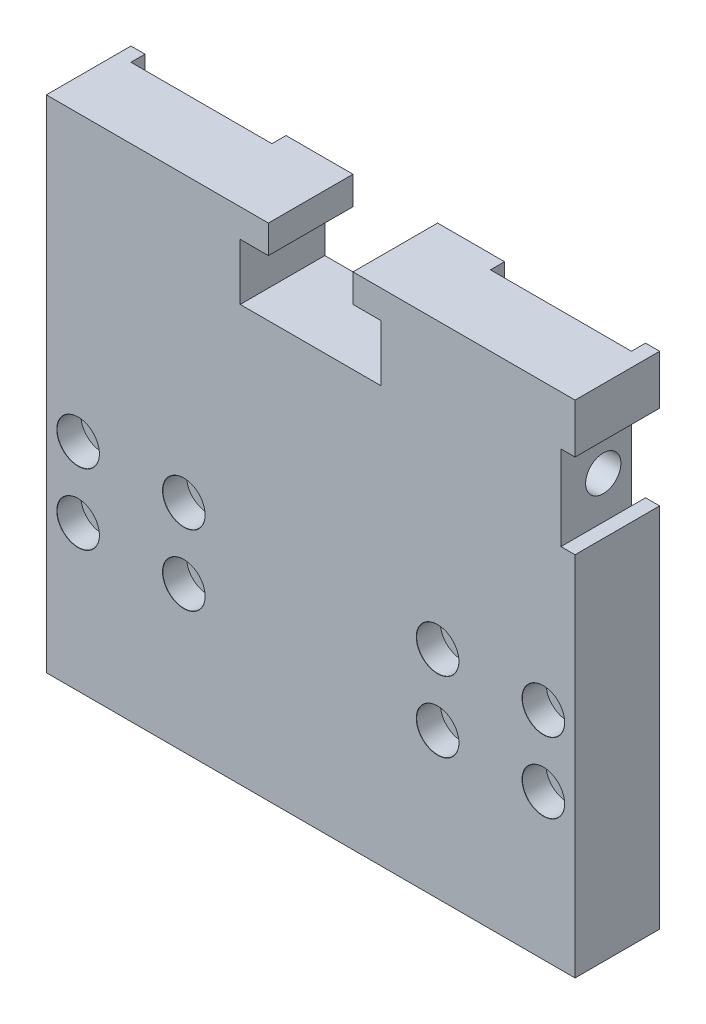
ISO-10303-21;
HEADER;
FILE_DESCRIPTION(('STEP AP214'),'2;1');
FILE_NAME('part.step','',(''),(''),'','','');
FILE_SCHEMA(('AUTOMOTIVE_DESIGN { 1 0 10303 214 1 1 1 1 }'));
ENDSEC;
DATA;
#1=APPLICATION_CONTEXT('core data for automotive mechanical design processes');
#2=APPLICATION_PROTOCOL_DEFINITION('international standard','automotive_design',2000,#1);
#3=PRODUCT_CONTEXT('',#1,'mechanical');
#4=PRODUCT('Part','Part','',(#3));
#5=PRODUCT_RELATED_PRODUCT_CATEGORY('part','',(#4));
#6=PRODUCT_DEFINITION_FORMATION('','',#4);
#7=PRODUCT_DEFINITION_CONTEXT('part definition',#1,'design');
#8=PRODUCT_DEFINITION('design','',#6,#7);
#9=PRODUCT_DEFINITION_SHAPE('','',#8);
#10=(LENGTH_UNIT() NAMED_UNIT(*) SI_UNIT(.MILLI.,.METRE.));
#11=(NAMED_UNIT(*) PLANE_ANGLE_UNIT() SI_UNIT($,.RADIAN.));
#12=(NAMED_UNIT(*) SI_UNIT($,.STERADIAN.) SOLID_ANGLE_UNIT());
#13=UNCERTAINTY_MEASURE_WITH_UNIT(LENGTH_MEASURE(1.E-05),#10,'distance_accuracy_value','');
#14=(GEOMETRIC_REPRESENTATION_CONTEXT(3) GLOBAL_UNCERTAINTY_ASSIGNED_CONTEXT((#13)) GLOBAL_UNIT_ASSIGNED_CONTEXT((#10,
#11,#12)) REPRESENTATION_CONTEXT('',''));
#15=CARTESIAN_POINT('',(0.,0.,0.));
#16=DIRECTION('',(0.,0.,1.));
#17=DIRECTION('',(1.,0.,0.));
#18=AXIS2_PLACEMENT_3D('',#15,#16,#17);
#19=CARTESIAN_POINT('',(0.,0.,0.));
#20=DIRECTION('',(0.,0.,1.));
#21=DIRECTION('',(1.,0.,0.));
#22=AXIS2_PLACEMENT_3D('',#19,#20,#21);
#23=PLANE('',#22);
#24=DIRECTION('',(0.,-1.,0.));
#25=VECTOR('',#24,1.);
#26=CARTESIAN_POINT('',(61.,61.,0.));
#27=LINE('',#26,#25);
#28=CARTESIAN_POINT('',(61.,42.,0.));
#29=VERTEX_POINT('',#28);
#30=CARTESIAN_POINT('',(61.,-10.,0.));
#31=VERTEX_POINT('',#30);
#32=EDGE_CURVE('E524',#29,#31,#27,.T.);
#33=ORIENTED_EDGE('',*,*,#32,.F.);
#34=DIRECTION('',(1.,0.,0.));
#35=VECTOR('',#34,1.);
#36=CARTESIAN_POINT('',(63.,42.,0.));
#37=LINE('',#36,#35);
#38=CARTESIAN_POINT('',(63.,42.,0.));
#39=VERTEX_POINT('',#38);
#40=EDGE_CURVE('E215',#29,#39,#37,.T.);
#41=ORIENTED_EDGE('',*,*,#40,.T.);
#42=DIRECTION('',(0.,1.,0.));
#43=VECTOR('',#42,1.);
#44=CARTESIAN_POINT('',(63.,-10.,0.));
#45=LINE('',#44,#43);
#46=CARTESIAN_POINT('',(63.,-10.,0.));
#47=VERTEX_POINT('',#46);
#48=EDGE_CURVE('E547',#47,#39,#45,.T.);
#49=ORIENTED_EDGE('',*,*,#48,.F.);
#50=DIRECTION('',(1.,0.,0.));
#51=VECTOR('',#50,1.);
#52=CARTESIAN_POINT('',(63.,-10.,0.));
#53=LINE('',#52,#51);
#54=EDGE_CURVE('E558',#31,#47,#53,.T.);
#55=ORIENTED_EDGE('',*,*,#54,.F.);
#56=EDGE_LOOP('',(#33,#41,#49,#55));
#57=FACE_BOUND('',#56,.T.);
#58=ADVANCED_FACE('F16',(#57),#23,.F.);
#59=CARTESIAN_POINT('',(63.,-10.,12.));
#60=DIRECTION('',(-1.,0.,0.));
#61=DIRECTION('',(0.,0.,1.));
#62=AXIS2_PLACEMENT_3D('',#59,#60,#61);
#63=PLANE('',#62);
#64=ORIENTED_EDGE('',*,*,#48,.T.);
#65=DIRECTION('',(0.,0.,1.));
#66=VECTOR('',#65,1.);
#67=CARTESIAN_POINT('',(63.,42.,0.));
#68=LINE('',#67,#66);
#69=CARTESIAN_POINT('',(63.,42.,12.));
#70=VERTEX_POINT('',#69);
#71=EDGE_CURVE('E223',#39,#70,#68,.T.);
#72=ORIENTED_EDGE('',*,*,#71,.T.);
#73=DIRECTION('',(0.,1.,0.));
#74=VECTOR('',#73,1.);
#75=CARTESIAN_POINT('',(63.,-10.,12.));
#76=LINE('',#75,#74);
#77=CARTESIAN_POINT('',(63.,-10.,12.));
#78=VERTEX_POINT('',#77);
#79=EDGE_CURVE('E534',#78,#70,#76,.T.);
#80=ORIENTED_EDGE('',*,*,#79,.F.);
#81=DIRECTION('',(0.,0.,-1.));
#82=VECTOR('',#81,1.);
#83=CARTESIAN_POINT('',(63.,-10.,12.));
#84=LINE('',#83,#82);
#85=EDGE_CURVE('E546',#78,#47,#84,.T.);
#86=ORIENTED_EDGE('',*,*,#85,.T.);
#87=EDGE_LOOP('',(#64,#72,#80,#86));
#88=FACE_BOUND('',#87,.T.);
#89=ADVANCED_FACE('F620',(#88),#63,.F.);
#90=CARTESIAN_POINT('',(61.,61.,0.));
#91=DIRECTION('',(1.,0.,0.));
#92=DIRECTION('',(0.,1.,0.));
#93=AXIS2_PLACEMENT_3D('',#90,#91,#92);
#94=PLANE('',#93);
#95=DIRECTION('',(0.,-1.,0.));
#96=VECTOR('',#95,1.);
#97=CARTESIAN_POINT('',(61.,61.,2.));
#98=LINE('',#97,#96);
#99=CARTESIAN_POINT('',(61.,42.,2.));
#100=VERTEX_POINT('',#99);
#101=CARTESIAN_POINT('',(61.,-10.,2.));
#102=VERTEX_POINT('',#101);
#103=EDGE_CURVE('E512',#100,#102,#98,.T.);
#104=ORIENTED_EDGE('',*,*,#103,.F.);
#105=DIRECTION('',(0.,0.,1.));
#106=VECTOR('',#105,1.);
#107=CARTESIAN_POINT('',(61.,42.,0.));
#108=LINE('',#107,#106);
#109=EDGE_CURVE('E31',#29,#100,#108,.T.);
#110=ORIENTED_EDGE('',*,*,#109,.F.);
#111=ORIENTED_EDGE('',*,*,#32,.T.);
#112=DIRECTION('',(0.,0.,1.));
#113=VECTOR('',#112,1.);
#114=CARTESIAN_POINT('',(61.,-10.,0.));
#115=LINE('',#114,#113);
#116=EDGE_CURVE('E496',#31,#102,#115,.T.);
#117=ORIENTED_EDGE('',*,*,#116,.T.);
#118=EDGE_LOOP('',(#104,#110,#111,#117));
#119=FACE_BOUND('',#118,.T.);
#120=ADVANCED_FACE('F624',(#119),#94,.F.);
#121=CARTESIAN_POINT('',(63.,61.,12.));
#122=DIRECTION('',(0.,-1.,0.));
#123=DIRECTION('',(1.,0.,0.));
#124=AXIS2_PLACEMENT_3D('',#121,#122,#123);
#125=PLANE('',#124);
#126=DIRECTION('',(-1.,0.,0.));
#127=VECTOR('',#126,1.);
#128=CARTESIAN_POINT('',(63.,61.,12.));
#129=LINE('',#128,#127);
#130=CARTESIAN_POINT('',(19.5,61.,12.));
#131=VERTEX_POINT('',#130);
#132=CARTESIAN_POINT('',(-12.,61.,12.));
#133=VERTEX_POINT('',#132);
#134=EDGE_CURVE('E537',#131,#133,#129,.T.);
#135=ORIENTED_EDGE('',*,*,#134,.F.);
#136=DIRECTION('',(0.,0.,1.));
#137=VECTOR('',#136,1.);
#138=CARTESIAN_POINT('',(19.5,61.,0.));
#139=LINE('',#138,#137);
#140=CARTESIAN_POINT('',(19.5,61.,0.));
#141=VERTEX_POINT('',#140);
#142=EDGE_CURVE('E450',#141,#131,#139,.T.);
#143=ORIENTED_EDGE('',*,*,#142,.F.);
#144=DIRECTION('',(-1.,0.,0.));
#145=VECTOR('',#144,1.);
#146=CARTESIAN_POINT('',(63.,61.,0.));
#147=LINE('',#146,#145);
#148=CARTESIAN_POINT('',(10.,61.,0.));
#149=VERTEX_POINT('',#148);
#150=EDGE_CURVE('E556',#141,#149,#147,.T.);
#151=ORIENTED_EDGE('',*,*,#150,.T.);
#152=DIRECTION('',(0.,0.,1.));
#153=VECTOR('',#152,1.);
#154=CARTESIAN_POINT('',(10.,61.,0.));
#155=LINE('',#154,#153);
#156=CARTESIAN_POINT('',(10.,61.,2.));
#157=VERTEX_POINT('',#156);
#158=EDGE_CURVE('E476',#149,#157,#155,.T.);
#159=ORIENTED_EDGE('',*,*,#158,.T.);
#160=DIRECTION('',(-1.,0.,0.));
#161=VECTOR('',#160,1.);
#162=CARTESIAN_POINT('',(-10.,61.,2.));
#163=LINE('',#162,#161);
#164=CARTESIAN_POINT('',(-10.,61.,2.));
#165=VERTEX_POINT('',#164);
#166=EDGE_CURVE('E479',#157,#165,#163,.T.);
#167=ORIENTED_EDGE('',*,*,#166,.T.);
#168=DIRECTION('',(0.,0.,-1.));
#169=VECTOR('',#168,1.);
#170=CARTESIAN_POINT('',(-10.,61.,0.));
#171=LINE('',#170,#169);
#172=CARTESIAN_POINT('',(-10.,61.,0.));
#173=VERTEX_POINT('',#172);
#174=EDGE_CURVE('E483',#165,#173,#171,.T.);
#175=ORIENTED_EDGE('',*,*,#174,.T.);
#176=CARTESIAN_POINT('',(-12.,61.,0.));
#177=VERTEX_POINT('',#176);
#178=EDGE_CURVE('E550',#173,#177,#147,.T.);
#179=ORIENTED_EDGE('',*,*,#178,.T.);
#180=DIRECTION('',(0.,0.,-1.));
#181=VECTOR('',#180,1.);
#182=CARTESIAN_POINT('',(-12.,61.,12.));
#183=LINE('',#182,#181);
#184=EDGE_CURVE('E24',#133,#177,#183,.T.);
#185=ORIENTED_EDGE('',*,*,#184,.F.);
#186=EDGE_LOOP('',(#135,#143,#151,#159,#167,#175,#179,#185));
#187=FACE_BOUND('',#186,.T.);
#188=ADVANCED_FACE('F594',(#187),#125,.F.);
#189=ORIENTED_EDGE('',*,*,#178,.F.);
#190=DIRECTION('',(0.,-1.,0.));
#191=VECTOR('',#190,1.);
#192=CARTESIAN_POINT('',(-10.,61.,0.));
#193=LINE('',#192,#191);
#194=CARTESIAN_POINT('',(-10.,-10.,0.));
#195=VERTEX_POINT('',#194);
#196=EDGE_CURVE('E493',#173,#195,#193,.T.);
#197=ORIENTED_EDGE('',*,*,#196,.T.);
#198=CARTESIAN_POINT('',(-12.,-10.,0.));
#199=VERTEX_POINT('',#198);
#200=EDGE_CURVE('E559',#199,#195,#53,.T.);
#201=ORIENTED_EDGE('',*,*,#200,.F.);
#202=DIRECTION('',(0.,-1.,0.));
#203=VECTOR('',#202,1.);
#204=CARTESIAN_POINT('',(-12.,-10.,0.));
#205=LINE('',#204,#203);
#206=EDGE_CURVE('E554',#177,#199,#205,.T.);
#207=ORIENTED_EDGE('',*,*,#206,.F.);
#208=EDGE_LOOP('',(#189,#197,#201,#207));
#209=FACE_BOUND('',#208,.T.);
#210=ADVANCED_FACE('F579',(#209),#23,.F.);
#211=CARTESIAN_POINT('',(63.,54.,0.));
#212=VERTEX_POINT('',#211);
#213=CARTESIAN_POINT('',(63.,61.,0.));
#214=VERTEX_POINT('',#213);
#215=EDGE_CURVE('E523',#212,#214,#45,.T.);
#216=ORIENTED_EDGE('',*,*,#215,.F.);
#217=DIRECTION('',(-1.,0.,0.));
#218=VECTOR('',#217,1.);
#219=CARTESIAN_POINT('',(63.,54.,0.));
#220=LINE('',#219,#218);
#221=CARTESIAN_POINT('',(61.,54.,0.));
#222=VERTEX_POINT('',#221);
#223=EDGE_CURVE('E212',#212,#222,#220,.T.);
#224=ORIENTED_EDGE('',*,*,#223,.T.);
#225=CARTESIAN_POINT('',(61.,61.,0.));
#226=VERTEX_POINT('',#225);
#227=EDGE_CURVE('E520',#226,#222,#27,.T.);
#228=ORIENTED_EDGE('',*,*,#227,.F.);
#229=EDGE_CURVE('E551',#214,#226,#147,.T.);
#230=ORIENTED_EDGE('',*,*,#229,.F.);
#231=EDGE_LOOP('',(#216,#224,#228,#230));
#232=FACE_BOUND('',#231,.T.);
#233=ADVANCED_FACE('F641',(#232),#23,.F.);
#234=CARTESIAN_POINT('',(63.,54.,12.));
#235=VERTEX_POINT('',#234);
#236=CARTESIAN_POINT('',(63.,61.,12.));
#237=VERTEX_POINT('',#236);
#238=EDGE_CURVE('E538',#235,#237,#76,.T.);
#239=ORIENTED_EDGE('',*,*,#238,.F.);
#240=DIRECTION('',(0.,0.,1.));
#241=VECTOR('',#240,1.);
#242=CARTESIAN_POINT('',(63.,54.,0.));
#243=LINE('',#242,#241);
#244=EDGE_CURVE('E218',#212,#235,#243,.T.);
#245=ORIENTED_EDGE('',*,*,#244,.F.);
#246=ORIENTED_EDGE('',*,*,#215,.T.);
#247=DIRECTION('',(0.,0.,-1.));
#248=VECTOR('',#247,1.);
#249=CARTESIAN_POINT('',(63.,61.,12.));
#250=LINE('',#249,#248);
#251=EDGE_CURVE('E11',#237,#214,#250,.T.);
#252=ORIENTED_EDGE('',*,*,#251,.F.);
#253=EDGE_LOOP('',(#239,#245,#246,#252));
#254=FACE_BOUND('',#253,.T.);
#255=ADVANCED_FACE('F18',(#254),#63,.F.);
#256=CARTESIAN_POINT('',(41.,61.,0.));
#257=VERTEX_POINT('',#256);
#258=CARTESIAN_POINT('',(31.5,61.,0.));
#259=VERTEX_POINT('',#258);
#260=EDGE_CURVE('E555',#257,#259,#147,.T.);
#261=ORIENTED_EDGE('',*,*,#260,.T.);
#262=DIRECTION('',(0.,0.,1.));
#263=VECTOR('',#262,1.);
#264=CARTESIAN_POINT('',(31.5,61.,0.));
#265=LINE('',#264,#263);
#266=CARTESIAN_POINT('',(31.5,61.,12.));
#267=VERTEX_POINT('',#266);
#268=EDGE_CURVE('E452',#259,#267,#265,.T.);
#269=ORIENTED_EDGE('',*,*,#268,.T.);
#270=EDGE_CURVE('E539',#237,#267,#129,.T.);
#271=ORIENTED_EDGE('',*,*,#270,.F.);
#272=ORIENTED_EDGE('',*,*,#251,.T.);
#273=ORIENTED_EDGE('',*,*,#229,.T.);
#274=DIRECTION('',(0.,0.,1.));
#275=VECTOR('',#274,1.);
#276=CARTESIAN_POINT('',(61.,61.,0.));
#277=LINE('',#276,#275);
#278=CARTESIAN_POINT('',(61.,61.,2.));
#279=VERTEX_POINT('',#278);
#280=EDGE_CURVE('E502',#226,#279,#277,.T.);
#281=ORIENTED_EDGE('',*,*,#280,.T.);
#282=DIRECTION('',(-1.,0.,0.));
#283=VECTOR('',#282,1.);
#284=CARTESIAN_POINT('',(61.,61.,2.));
#285=LINE('',#284,#283);
#286=CARTESIAN_POINT('',(41.,61.,2.));
#287=VERTEX_POINT('',#286);
#288=EDGE_CURVE('E505',#279,#287,#285,.T.);
#289=ORIENTED_EDGE('',*,*,#288,.T.);
#290=DIRECTION('',(0.,0.,-1.));
#291=VECTOR('',#290,1.);
#292=CARTESIAN_POINT('',(41.,61.,0.));
#293=LINE('',#292,#291);
#294=EDGE_CURVE('E509',#287,#257,#293,.T.);
#295=ORIENTED_EDGE('',*,*,#294,.T.);
#296=EDGE_LOOP('',(#261,#269,#271,#272,#273,#281,#289,#295));
#297=FACE_BOUND('',#296,.T.);
#298=ADVANCED_FACE('F643',(#297),#125,.F.);
#299=CARTESIAN_POINT('',(-12.,-10.,12.));
#300=DIRECTION('',(1.,0.,0.));
#301=DIRECTION('',(0.,0.,-1.));
#302=AXIS2_PLACEMENT_3D('',#299,#300,#301);
#303=PLANE('',#302);
#304=ORIENTED_EDGE('',*,*,#206,.T.);
#305=DIRECTION('',(0.,0.,-1.));
#306=VECTOR('',#305,1.);
#307=CARTESIAN_POINT('',(-12.,-10.,12.));
#308=LINE('',#307,#306);
#309=CARTESIAN_POINT('',(-12.,-10.,12.));
#310=VERTEX_POINT('',#309);
#311=EDGE_CURVE('E565',#310,#199,#308,.T.);
#312=ORIENTED_EDGE('',*,*,#311,.F.);
#313=DIRECTION('',(0.,-1.,0.));
#314=VECTOR('',#313,1.);
#315=CARTESIAN_POINT('',(-12.,-10.,12.));
#316=LINE('',#315,#314);
#317=EDGE_CURVE('E542',#133,#310,#316,.T.);
#318=ORIENTED_EDGE('',*,*,#317,.F.);
#319=ORIENTED_EDGE('',*,*,#184,.T.);
#320=EDGE_LOOP('',(#304,#312,#318,#319));
#321=FACE_BOUND('',#320,.T.);
#322=ADVANCED_FACE('F572',(#321),#303,.F.);
#323=CARTESIAN_POINT('',(63.,-10.,12.));
#324=DIRECTION('',(0.,1.,0.));
#325=DIRECTION('',(-1.,0.,0.));
#326=AXIS2_PLACEMENT_3D('',#323,#324,#325);
#327=PLANE('',#326);
#328=CARTESIAN_POINT('',(0.,-10.,6.));
#329=DIRECTION('',(0.,-1.,0.));
#330=DIRECTION('',(0.,0.,-1.));
#331=AXIS2_PLACEMENT_3D('',#328,#329,#330);
#332=CIRCLE('',#331,2.1);
#333=CARTESIAN_POINT('',(0.,-10.,3.9));
#334=VERTEX_POINT('',#333);
#335=EDGE_CURVE('E443',#334,#334,#332,.T.);
#336=ORIENTED_EDGE('',*,*,#335,.F.);
#337=EDGE_LOOP('',(#336));
#338=FACE_BOUND('',#337,.T.);
#339=CARTESIAN_POINT('',(25.5,-10.,6.));
#340=DIRECTION('',(0.,-1.,0.));
#341=DIRECTION('',(0.,0.,-1.));
#342=AXIS2_PLACEMENT_3D('',#339,#340,#341);
#343=CIRCLE('',#342,2.1);
#344=CARTESIAN_POINT('',(25.5,-10.,3.9));
#345=VERTEX_POINT('',#344);
#346=EDGE_CURVE('E463',#345,#345,#343,.T.);
#347=ORIENTED_EDGE('',*,*,#346,.F.);
#348=EDGE_LOOP('',(#347));
#349=FACE_BOUND('',#348,.T.);
#350=CARTESIAN_POINT('',(51.,-10.,6.));
#351=DIRECTION('',(0.,-1.,0.));
#352=DIRECTION('',(0.,0.,-1.));
#353=AXIS2_PLACEMENT_3D('',#350,#351,#352);
#354=CIRCLE('',#353,2.1);
#355=CARTESIAN_POINT('',(51.,-10.,3.9));
#356=VERTEX_POINT('',#355);
#357=EDGE_CURVE('E469',#356,#356,#354,.T.);
#358=ORIENTED_EDGE('',*,*,#357,.F.);
#359=EDGE_LOOP('',(#358));
#360=FACE_BOUND('',#359,.T.);
#361=ORIENTED_EDGE('',*,*,#200,.T.);
#362=DIRECTION('',(0.,0.,-1.));
#363=VECTOR('',#362,1.);
#364=CARTESIAN_POINT('',(-10.,-10.,0.));
#365=LINE('',#364,#363);
#366=CARTESIAN_POINT('',(-10.,-10.,2.));
#367=VERTEX_POINT('',#366);
#368=EDGE_CURVE('E480',#367,#195,#365,.T.);
#369=ORIENTED_EDGE('',*,*,#368,.F.);
#370=DIRECTION('',(-1.,0.,0.));
#371=VECTOR('',#370,1.);
#372=CARTESIAN_POINT('',(-10.,-10.,2.));
#373=LINE('',#372,#371);
#374=CARTESIAN_POINT('',(10.,-10.,2.));
#375=VERTEX_POINT('',#374);
#376=EDGE_CURVE('E489',#375,#367,#373,.T.);
#377=ORIENTED_EDGE('',*,*,#376,.F.);
#378=DIRECTION('',(0.,0.,1.));
#379=VECTOR('',#378,1.);
#380=CARTESIAN_POINT('',(10.,-10.,0.));
#381=LINE('',#380,#379);
#382=CARTESIAN_POINT('',(10.,-10.,0.));
#383=VERTEX_POINT('',#382);
#384=EDGE_CURVE('E475',#383,#375,#381,.T.);
#385=ORIENTED_EDGE('',*,*,#384,.F.);
#386=CARTESIAN_POINT('',(41.,-10.,0.));
#387=VERTEX_POINT('',#386);
#388=EDGE_CURVE('E562',#383,#387,#53,.T.);
#389=ORIENTED_EDGE('',*,*,#388,.T.);
#390=DIRECTION('',(0.,0.,-1.));
#391=VECTOR('',#390,1.);
#392=CARTESIAN_POINT('',(41.,-10.,0.));
#393=LINE('',#392,#391);
#394=CARTESIAN_POINT('',(41.,-10.,2.));
#395=VERTEX_POINT('',#394);
#396=EDGE_CURVE('E506',#395,#387,#393,.T.);
#397=ORIENTED_EDGE('',*,*,#396,.F.);
#398=DIRECTION('',(-1.,0.,0.));
#399=VECTOR('',#398,1.);
#400=CARTESIAN_POINT('',(61.,-10.,2.));
#401=LINE('',#400,#399);
#402=EDGE_CURVE('E515',#102,#395,#401,.T.);
#403=ORIENTED_EDGE('',*,*,#402,.F.);
#404=ORIENTED_EDGE('',*,*,#116,.F.);
#405=ORIENTED_EDGE('',*,*,#54,.T.);
#406=ORIENTED_EDGE('',*,*,#85,.F.);
#407=DIRECTION('',(1.,0.,0.));
#408=VECTOR('',#407,1.);
#409=CARTESIAN_POINT('',(63.,-10.,12.));
#410=LINE('',#409,#408);
#411=EDGE_CURVE('E544',#310,#78,#410,.T.);
#412=ORIENTED_EDGE('',*,*,#411,.F.);
#413=ORIENTED_EDGE('',*,*,#311,.T.);
#414=EDGE_LOOP('',(#361,#369,#377,#385,#389,#397,#403,#404,#405,#406,#412,#413));
#415=FACE_BOUND('',#414,.T.);
#416=ADVANCED_FACE('F582',(#338,#349,#360,#415),#327,.F.);
#417=CARTESIAN_POINT('',(0.,0.,12.));
#418=DIRECTION('',(0.,0.,1.));
#419=DIRECTION('',(1.,0.,0.));
#420=AXIS2_PLACEMENT_3D('',#417,#418,#419);
#421=PLANE('',#420);
#422=DIRECTION('',(1.,0.,0.));
#423=VECTOR('',#422,1.);
#424=CARTESIAN_POINT('',(63.,42.,12.));
#425=LINE('',#424,#423);
#426=CARTESIAN_POINT('',(61.,42.,12.));
#427=VERTEX_POINT('',#426);
#428=EDGE_CURVE('E216',#427,#70,#425,.T.);
#429=ORIENTED_EDGE('',*,*,#428,.F.);
#430=DIRECTION('',(0.,-1.,0.));
#431=VECTOR('',#430,1.);
#432=CARTESIAN_POINT('',(61.,54.,12.));
#433=LINE('',#432,#431);
#434=CARTESIAN_POINT('',(61.,54.,12.));
#435=VERTEX_POINT('',#434);
#436=EDGE_CURVE('E207',#435,#427,#433,.T.);
#437=ORIENTED_EDGE('',*,*,#436,.F.);
#438=DIRECTION('',(-1.,0.,0.));
#439=VECTOR('',#438,1.);
#440=CARTESIAN_POINT('',(63.,54.,12.));
#441=LINE('',#440,#439);
#442=EDGE_CURVE('E203',#235,#435,#441,.T.);
#443=ORIENTED_EDGE('',*,*,#442,.F.);
#444=ORIENTED_EDGE('',*,*,#238,.T.);
#445=ORIENTED_EDGE('',*,*,#270,.T.);
#446=DIRECTION('',(0.,1.,0.));
#447=VECTOR('',#446,1.);
#448=CARTESIAN_POINT('',(31.5,61.,12.));
#449=LINE('',#448,#447);
#450=CARTESIAN_POINT('',(31.5,57.,12.));
#451=VERTEX_POINT('',#450);
#452=EDGE_CURVE('E428',#451,#267,#449,.T.);
#453=ORIENTED_EDGE('',*,*,#452,.F.);
#454=DIRECTION('',(-1.,0.,0.));
#455=VECTOR('',#454,1.);
#456=CARTESIAN_POINT('',(31.5,57.,12.));
#457=LINE('',#456,#455);
#458=CARTESIAN_POINT('',(35.5,57.,12.));
#459=VERTEX_POINT('',#458);
#460=EDGE_CURVE('E425',#459,#451,#457,.T.);
#461=ORIENTED_EDGE('',*,*,#460,.F.);
#462=DIRECTION('',(0.,1.,0.));
#463=VECTOR('',#462,1.);
#464=CARTESIAN_POINT('',(35.5,57.,12.));
#465=LINE('',#464,#463);
#466=CARTESIAN_POINT('',(35.5,49.,12.));
#467=VERTEX_POINT('',#466);
#468=EDGE_CURVE('E401',#467,#459,#465,.T.);
#469=ORIENTED_EDGE('',*,*,#468,.F.);
#470=DIRECTION('',(1.,0.,0.));
#471=VECTOR('',#470,1.);
#472=CARTESIAN_POINT('',(15.5,49.,12.));
#473=LINE('',#472,#471);
#474=CARTESIAN_POINT('',(15.5,49.,12.));
#475=VERTEX_POINT('',#474);
#476=EDGE_CURVE('E406',#475,#467,#473,.T.);
#477=ORIENTED_EDGE('',*,*,#476,.F.);
#478=DIRECTION('',(0.,-1.,0.));
#479=VECTOR('',#478,1.);
#480=CARTESIAN_POINT('',(15.5,57.,12.));
#481=LINE('',#480,#479);
#482=CARTESIAN_POINT('',(15.5,57.,12.));
#483=VERTEX_POINT('',#482);
#484=EDGE_CURVE('E436',#483,#475,#481,.T.);
#485=ORIENTED_EDGE('',*,*,#484,.F.);
#486=DIRECTION('',(-1.,0.,0.));
#487=VECTOR('',#486,1.);
#488=CARTESIAN_POINT('',(19.5,57.,12.));
#489=LINE('',#488,#487);
#490=CARTESIAN_POINT('',(19.5,57.,12.));
#491=VERTEX_POINT('',#490);
#492=EDGE_CURVE('E433',#491,#483,#489,.T.);
#493=ORIENTED_EDGE('',*,*,#492,.F.);
#494=DIRECTION('',(0.,-1.,0.));
#495=VECTOR('',#494,1.);
#496=CARTESIAN_POINT('',(19.5,61.,12.));
#497=LINE('',#496,#495);
#498=EDGE_CURVE('E430',#131,#491,#497,.T.);
#499=ORIENTED_EDGE('',*,*,#498,.F.);
#500=ORIENTED_EDGE('',*,*,#134,.T.);
#501=ORIENTED_EDGE('',*,*,#317,.T.);
#502=ORIENTED_EDGE('',*,*,#411,.T.);
#503=ORIENTED_EDGE('',*,*,#79,.T.);
#504=EDGE_LOOP('',(#429,#437,#443,#444,#445,#453,#461,#469,#477,#485,#493,#499,#500,#501,#502,#503));
#505=FACE_BOUND('',#504,.T.);
#506=CARTESIAN_POINT('',(43.5,10.65,12.));
#507=DIRECTION('',(0.,0.,1.));
#508=DIRECTION('',(1.,0.,0.));
#509=AXIS2_PLACEMENT_3D('',#506,#507,#508);
#510=CIRCLE('',#509,3.025);
#511=CARTESIAN_POINT('',(46.525,10.65,12.));
#512=VERTEX_POINT('',#511);
#513=EDGE_CURVE('E236',#512,#512,#510,.T.);
#514=ORIENTED_EDGE('',*,*,#513,.F.);
#515=EDGE_LOOP('',(#514));
#516=FACE_BOUND('',#515,.T.);
#517=CARTESIAN_POINT('',(43.5,20.65,12.));
#518=DIRECTION('',(0.,0.,1.));
#519=DIRECTION('',(1.,0.,0.));
#520=AXIS2_PLACEMENT_3D('',#517,#518,#519);
#521=CIRCLE('',#520,3.025);
#522=CARTESIAN_POINT('',(46.525,20.65,12.));
#523=VERTEX_POINT('',#522);
#524=EDGE_CURVE('E257',#523,#523,#521,.T.);
#525=ORIENTED_EDGE('',*,*,#524,.F.);
#526=EDGE_LOOP('',(#525));
#527=FACE_BOUND('',#526,.T.);
#528=CARTESIAN_POINT('',(58.5,20.65,12.));
#529=DIRECTION('',(0.,0.,1.));
#530=DIRECTION('',(1.,0.,0.));
#531=AXIS2_PLACEMENT_3D('',#528,#529,#530);
#532=CIRCLE('',#531,3.025);
#533=CARTESIAN_POINT('',(61.525,20.65,12.));
#534=VERTEX_POINT('',#533);
#535=EDGE_CURVE('E278',#534,#534,#532,.T.);
#536=ORIENTED_EDGE('',*,*,#535,.F.);
#537=EDGE_LOOP('',(#536));
#538=FACE_BOUND('',#537,.T.);
#539=CARTESIAN_POINT('',(7.5,10.65,12.));
#540=DIRECTION('',(0.,0.,1.));
#541=DIRECTION('',(1.,0.,0.));
#542=AXIS2_PLACEMENT_3D('',#539,#540,#541);
#543=CIRCLE('',#542,3.025);
#544=CARTESIAN_POINT('',(10.525,10.65,12.));
#545=VERTEX_POINT('',#544);
#546=EDGE_CURVE('E299',#545,#545,#543,.T.);
#547=ORIENTED_EDGE('',*,*,#546,.F.);
#548=EDGE_LOOP('',(#547));
#549=FACE_BOUND('',#548,.T.);
#550=CARTESIAN_POINT('',(7.5,20.65,12.));
#551=DIRECTION('',(0.,0.,1.));
#552=DIRECTION('',(1.,0.,0.));
#553=AXIS2_PLACEMENT_3D('',#550,#551,#552);
#554=CIRCLE('',#553,3.025);
#555=CARTESIAN_POINT('',(10.525,20.65,12.));
#556=VERTEX_POINT('',#555);
#557=EDGE_CURVE('E320',#556,#556,#554,.T.);
#558=ORIENTED_EDGE('',*,*,#557,.F.);
#559=EDGE_LOOP('',(#558));
#560=FACE_BOUND('',#559,.T.);
#561=CARTESIAN_POINT('',(-7.5,20.65,12.));
#562=DIRECTION('',(0.,0.,1.));
#563=DIRECTION('',(1.,0.,0.));
#564=AXIS2_PLACEMENT_3D('',#561,#562,#563);
#565=CIRCLE('',#564,3.025);
#566=CARTESIAN_POINT('',(-4.475,20.65,12.));
#567=VERTEX_POINT('',#566);
#568=EDGE_CURVE('E341',#567,#567,#565,.T.);
#569=ORIENTED_EDGE('',*,*,#568,.F.);
#570=EDGE_LOOP('',(#569));
#571=FACE_BOUND('',#570,.T.);
#572=CARTESIAN_POINT('',(-7.5,10.65,12.));
#573=DIRECTION('',(0.,0.,1.));
#574=DIRECTION('',(1.,0.,0.));
#575=AXIS2_PLACEMENT_3D('',#572,#573,#574);
#576=CIRCLE('',#575,3.025);
#577=CARTESIAN_POINT('',(-4.475,10.65,12.));
#578=VERTEX_POINT('',#577);
#579=EDGE_CURVE('E362',#578,#578,#576,.T.);
#580=ORIENTED_EDGE('',*,*,#579,.F.);
#581=EDGE_LOOP('',(#580));
#582=FACE_BOUND('',#581,.T.);
#583=CARTESIAN_POINT('',(58.5,10.65,12.));
#584=DIRECTION('',(0.,0.,1.));
#585=DIRECTION('',(1.,0.,0.));
#586=AXIS2_PLACEMENT_3D('',#583,#584,#585);
#587=CIRCLE('',#586,3.025);
#588=CARTESIAN_POINT('',(61.525,10.65,12.));
#589=VERTEX_POINT('',#588);
#590=EDGE_CURVE('E383',#589,#589,#587,.T.);
#591=ORIENTED_EDGE('',*,*,#590,.F.);
#592=EDGE_LOOP('',(#591));
#593=FACE_BOUND('',#592,.T.);
#594=ADVANCED_FACE('F589',(#505,#516,#527,#538,#549,#560,#571,#582,#593),#421,.T.);
#595=ORIENTED_EDGE('',*,*,#150,.F.);
#596=DIRECTION('',(0.,-1.,0.));
#597=VECTOR('',#596,1.);
#598=CARTESIAN_POINT('',(19.5,61.,0.));
#599=LINE('',#598,#597);
#600=CARTESIAN_POINT('',(19.5,57.,0.));
#601=VERTEX_POINT('',#600);
#602=EDGE_CURVE('E410',#141,#601,#599,.T.);
#603=ORIENTED_EDGE('',*,*,#602,.T.);
#604=DIRECTION('',(-1.,0.,0.));
#605=VECTOR('',#604,1.);
#606=CARTESIAN_POINT('',(19.5,57.,0.));
#607=LINE('',#606,#605);
#608=CARTESIAN_POINT('',(15.5,57.,0.));
#609=VERTEX_POINT('',#608);
#610=EDGE_CURVE('E413',#601,#609,#607,.T.);
#611=ORIENTED_EDGE('',*,*,#610,.T.);
#612=DIRECTION('',(0.,-1.,0.));
#613=VECTOR('',#612,1.);
#614=CARTESIAN_POINT('',(15.5,57.,0.));
#615=LINE('',#614,#613);
#616=CARTESIAN_POINT('',(15.5,49.,0.));
#617=VERTEX_POINT('',#616);
#618=EDGE_CURVE('E416',#609,#617,#615,.T.);
#619=ORIENTED_EDGE('',*,*,#618,.T.);
#620=DIRECTION('',(1.,0.,0.));
#621=VECTOR('',#620,1.);
#622=CARTESIAN_POINT('',(15.5,49.,0.));
#623=LINE('',#622,#621);
#624=CARTESIAN_POINT('',(35.5,49.,0.));
#625=VERTEX_POINT('',#624);
#626=EDGE_CURVE('E419',#617,#625,#623,.T.);
#627=ORIENTED_EDGE('',*,*,#626,.T.);
#628=DIRECTION('',(0.,1.,0.));
#629=VECTOR('',#628,1.);
#630=CARTESIAN_POINT('',(35.5,57.,0.));
#631=LINE('',#630,#629);
#632=CARTESIAN_POINT('',(35.5,57.,0.));
#633=VERTEX_POINT('',#632);
#634=EDGE_CURVE('E402',#625,#633,#631,.T.);
#635=ORIENTED_EDGE('',*,*,#634,.T.);
#636=DIRECTION('',(-1.,0.,0.));
#637=VECTOR('',#636,1.);
#638=CARTESIAN_POINT('',(31.5,57.,0.));
#639=LINE('',#638,#637);
#640=CARTESIAN_POINT('',(31.5,57.,0.));
#641=VERTEX_POINT('',#640);
#642=EDGE_CURVE('E405',#633,#641,#639,.T.);
#643=ORIENTED_EDGE('',*,*,#642,.T.);
#644=DIRECTION('',(0.,1.,0.));
#645=VECTOR('',#644,1.);
#646=CARTESIAN_POINT('',(31.5,61.,0.));
#647=LINE('',#646,#645);
#648=EDGE_CURVE('E39',#641,#259,#647,.T.);
#649=ORIENTED_EDGE('',*,*,#648,.T.);
#650=ORIENTED_EDGE('',*,*,#260,.F.);
#651=DIRECTION('',(0.,-1.,0.));
#652=VECTOR('',#651,1.);
#653=CARTESIAN_POINT('',(41.,61.,0.));
#654=LINE('',#653,#652);
#655=EDGE_CURVE('E525',#257,#387,#654,.T.);
#656=ORIENTED_EDGE('',*,*,#655,.T.);
#657=ORIENTED_EDGE('',*,*,#388,.F.);
#658=DIRECTION('',(0.,-1.,0.));
#659=VECTOR('',#658,1.);
#660=CARTESIAN_POINT('',(10.,61.,0.));
#661=LINE('',#660,#659);
#662=EDGE_CURVE('E486',#149,#383,#661,.T.);
#663=ORIENTED_EDGE('',*,*,#662,.F.);
#664=EDGE_LOOP('',(#595,#603,#611,#619,#627,#635,#643,#649,#650,#656,#657,#663));
#665=FACE_BOUND('',#664,.T.);
#666=ADVANCED_FACE('F600',(#665),#23,.F.);
#667=ORIENTED_EDGE('',*,*,#227,.T.);
#668=DIRECTION('',(0.,0.,1.));
#669=VECTOR('',#668,1.);
#670=CARTESIAN_POINT('',(61.,54.,0.));
#671=LINE('',#670,#669);
#672=CARTESIAN_POINT('',(61.,54.,2.));
#673=VERTEX_POINT('',#672);
#674=EDGE_CURVE('E229',#222,#673,#671,.T.);
#675=ORIENTED_EDGE('',*,*,#674,.T.);
#676=EDGE_CURVE('E530',#279,#673,#98,.T.);
#677=ORIENTED_EDGE('',*,*,#676,.F.);
#678=ORIENTED_EDGE('',*,*,#280,.F.);
#679=EDGE_LOOP('',(#667,#675,#677,#678));
#680=FACE_BOUND('',#679,.T.);
#681=ADVANCED_FACE('F636',(#680),#94,.F.);
#682=CARTESIAN_POINT('',(41.,61.,0.));
#683=DIRECTION('',(-1.,0.,0.));
#684=DIRECTION('',(0.,-1.,0.));
#685=AXIS2_PLACEMENT_3D('',#682,#683,#684);
#686=PLANE('',#685);
#687=ORIENTED_EDGE('',*,*,#396,.T.);
#688=ORIENTED_EDGE('',*,*,#655,.F.);
#689=ORIENTED_EDGE('',*,*,#294,.F.);
#690=DIRECTION('',(0.,-1.,0.));
#691=VECTOR('',#690,1.);
#692=CARTESIAN_POINT('',(41.,61.,2.));
#693=LINE('',#692,#691);
#694=EDGE_CURVE('E528',#287,#395,#693,.T.);
#695=ORIENTED_EDGE('',*,*,#694,.T.);
#696=EDGE_LOOP('',(#687,#688,#689,#695));
#697=FACE_BOUND('',#696,.T.);
#698=ADVANCED_FACE('F697',(#697),#686,.F.);
#699=CARTESIAN_POINT('',(61.,61.,2.));
#700=DIRECTION('',(0.,0.,1.));
#701=DIRECTION('',(1.,0.,0.));
#702=AXIS2_PLACEMENT_3D('',#699,#700,#701);
#703=PLANE('',#702);
#704=CARTESIAN_POINT('',(43.5,10.65,2.));
#705=DIRECTION('',(0.,0.,1.));
#706=DIRECTION('',(1.,0.,0.));
#707=AXIS2_PLACEMENT_3D('',#704,#705,#706);
#708=CIRCLE('',#707,1.725);
#709=CARTESIAN_POINT('',(45.225,10.65,2.));
#710=VERTEX_POINT('',#709);
#711=EDGE_CURVE('E226',#710,#710,#708,.T.);
#712=ORIENTED_EDGE('',*,*,#711,.T.);
#713=EDGE_LOOP('',(#712));
#714=FACE_BOUND('',#713,.T.);
#715=CARTESIAN_POINT('',(43.5,20.65,2.));
#716=DIRECTION('',(0.,0.,1.));
#717=DIRECTION('',(1.,0.,0.));
#718=AXIS2_PLACEMENT_3D('',#715,#716,#717);
#719=CIRCLE('',#718,1.725);
#720=CARTESIAN_POINT('',(45.225,20.65,2.));
#721=VERTEX_POINT('',#720);
#722=EDGE_CURVE('E254',#721,#721,#719,.T.);
#723=ORIENTED_EDGE('',*,*,#722,.T.);
#724=EDGE_LOOP('',(#723));
#725=FACE_BOUND('',#724,.T.);
#726=CARTESIAN_POINT('',(58.5,20.65,2.));
#727=DIRECTION('',(0.,0.,1.));
#728=DIRECTION('',(1.,0.,0.));
#729=AXIS2_PLACEMENT_3D('',#726,#727,#728);
#730=CIRCLE('',#729,1.725);
#731=CARTESIAN_POINT('',(60.225,20.65,2.));
#732=VERTEX_POINT('',#731);
#733=EDGE_CURVE('E275',#732,#732,#730,.T.);
#734=ORIENTED_EDGE('',*,*,#733,.T.);
#735=EDGE_LOOP('',(#734));
#736=FACE_BOUND('',#735,.T.);
#737=CARTESIAN_POINT('',(58.5,10.65,2.));
#738=DIRECTION('',(0.,0.,1.));
#739=DIRECTION('',(1.,0.,0.));
#740=AXIS2_PLACEMENT_3D('',#737,#738,#739);
#741=CIRCLE('',#740,1.725);
#742=CARTESIAN_POINT('',(60.225,10.65,2.));
#743=VERTEX_POINT('',#742);
#744=EDGE_CURVE('E380',#743,#743,#741,.T.);
#745=ORIENTED_EDGE('',*,*,#744,.T.);
#746=EDGE_LOOP('',(#745));
#747=FACE_BOUND('',#746,.T.);
#748=ORIENTED_EDGE('',*,*,#402,.T.);
#749=ORIENTED_EDGE('',*,*,#694,.F.);
#750=ORIENTED_EDGE('',*,*,#288,.F.);
#751=ORIENTED_EDGE('',*,*,#676,.T.);
#752=EDGE_CURVE('E533',#673,#100,#98,.T.);
#753=ORIENTED_EDGE('',*,*,#752,.T.);
#754=ORIENTED_EDGE('',*,*,#103,.T.);
#755=EDGE_LOOP('',(#748,#749,#750,#751,#753,#754));
#756=FACE_BOUND('',#755,.T.);
#757=ADVANCED_FACE('F627',(#714,#725,#736,#747,#756),#703,.F.);
#758=CARTESIAN_POINT('',(-10.,61.,0.));
#759=DIRECTION('',(-1.,0.,0.));
#760=DIRECTION('',(0.,-1.,0.));
#761=AXIS2_PLACEMENT_3D('',#758,#759,#760);
#762=PLANE('',#761);
#763=ORIENTED_EDGE('',*,*,#368,.T.);
#764=ORIENTED_EDGE('',*,*,#196,.F.);
#765=ORIENTED_EDGE('',*,*,#174,.F.);
#766=DIRECTION('',(0.,-1.,0.));
#767=VECTOR('',#766,1.);
#768=CARTESIAN_POINT('',(-10.,61.,2.));
#769=LINE('',#768,#767);
#770=EDGE_CURVE('E497',#165,#367,#769,.T.);
#771=ORIENTED_EDGE('',*,*,#770,.T.);
#772=EDGE_LOOP('',(#763,#764,#765,#771));
#773=FACE_BOUND('',#772,.T.);
#774=ADVANCED_FACE('F606',(#773),#762,.F.);
#775=CARTESIAN_POINT('',(-10.,61.,2.));
#776=DIRECTION('',(0.,0.,1.));
#777=DIRECTION('',(1.,0.,0.));
#778=AXIS2_PLACEMENT_3D('',#775,#776,#777);
#779=PLANE('',#778);
#780=CARTESIAN_POINT('',(7.5,10.65,2.));
#781=DIRECTION('',(0.,0.,1.));
#782=DIRECTION('',(1.,0.,0.));
#783=AXIS2_PLACEMENT_3D('',#780,#781,#782);
#784=CIRCLE('',#783,1.725);
#785=CARTESIAN_POINT('',(9.225,10.65,2.));
#786=VERTEX_POINT('',#785);
#787=EDGE_CURVE('E296',#786,#786,#784,.T.);
#788=ORIENTED_EDGE('',*,*,#787,.T.);
#789=EDGE_LOOP('',(#788));
#790=FACE_BOUND('',#789,.T.);
#791=CARTESIAN_POINT('',(7.5,20.65,2.));
#792=DIRECTION('',(0.,0.,1.));
#793=DIRECTION('',(1.,0.,0.));
#794=AXIS2_PLACEMENT_3D('',#791,#792,#793);
#795=CIRCLE('',#794,1.725);
#796=CARTESIAN_POINT('',(9.225,20.65,2.));
#797=VERTEX_POINT('',#796);
#798=EDGE_CURVE('E317',#797,#797,#795,.T.);
#799=ORIENTED_EDGE('',*,*,#798,.T.);
#800=EDGE_LOOP('',(#799));
#801=FACE_BOUND('',#800,.T.);
#802=CARTESIAN_POINT('',(-7.5,20.65,2.));
#803=DIRECTION('',(0.,0.,1.));
#804=DIRECTION('',(1.,0.,0.));
#805=AXIS2_PLACEMENT_3D('',#802,#803,#804);
#806=CIRCLE('',#805,1.725);
#807=CARTESIAN_POINT('',(-5.775,20.65,2.));
#808=VERTEX_POINT('',#807);
#809=EDGE_CURVE('E338',#808,#808,#806,.T.);
#810=ORIENTED_EDGE('',*,*,#809,.T.);
#811=EDGE_LOOP('',(#810));
#812=FACE_BOUND('',#811,.T.);
#813=CARTESIAN_POINT('',(-7.5,10.65,2.));
#814=DIRECTION('',(0.,0.,1.));
#815=DIRECTION('',(1.,0.,0.));
#816=AXIS2_PLACEMENT_3D('',#813,#814,#815);
#817=CIRCLE('',#816,1.725);
#818=CARTESIAN_POINT('',(-5.775,10.65,2.));
#819=VERTEX_POINT('',#818);
#820=EDGE_CURVE('E359',#819,#819,#817,.T.);
#821=ORIENTED_EDGE('',*,*,#820,.T.);
#822=EDGE_LOOP('',(#821));
#823=FACE_BOUND('',#822,.T.);
#824=ORIENTED_EDGE('',*,*,#376,.T.);
#825=ORIENTED_EDGE('',*,*,#770,.F.);
#826=ORIENTED_EDGE('',*,*,#166,.F.);
#827=DIRECTION('',(0.,-1.,0.));
#828=VECTOR('',#827,1.);
#829=CARTESIAN_POINT('',(10.,61.,2.));
#830=LINE('',#829,#828);
#831=EDGE_CURVE('E499',#157,#375,#830,.T.);
#832=ORIENTED_EDGE('',*,*,#831,.T.);
#833=EDGE_LOOP('',(#824,#825,#826,#832));
#834=FACE_BOUND('',#833,.T.);
#835=ADVANCED_FACE('F608',(#790,#801,#812,#823,#834),#779,.F.);
#836=CARTESIAN_POINT('',(10.,61.,0.));
#837=DIRECTION('',(1.,0.,0.));
#838=DIRECTION('',(0.,1.,0.));
#839=AXIS2_PLACEMENT_3D('',#836,#837,#838);
#840=PLANE('',#839);
#841=ORIENTED_EDGE('',*,*,#384,.T.);
#842=ORIENTED_EDGE('',*,*,#831,.F.);
#843=ORIENTED_EDGE('',*,*,#158,.F.);
#844=ORIENTED_EDGE('',*,*,#662,.T.);
#845=EDGE_LOOP('',(#841,#842,#843,#844));
#846=FACE_BOUND('',#845,.T.);
#847=ADVANCED_FACE('F728',(#846),#840,.F.);
#848=CARTESIAN_POINT('',(51.,6.,6.));
#849=DIRECTION('',(0.,-1.,0.));
#850=DIRECTION('',(0.,0.,-1.));
#851=AXIS2_PLACEMENT_3D('',#848,#849,#850);
#852=CONICAL_SURFACE('',#851,2.1,1.02974425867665);
#853=CARTESIAN_POINT('',(51.,7.26180729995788,6.));
#854=VERTEX_POINT('',#853);
#855=VERTEX_LOOP('',#854);
#856=FACE_BOUND('',#855,.T.);
#857=CARTESIAN_POINT('',(51.,6.,6.));
#858=DIRECTION('',(0.,-1.,0.));
#859=DIRECTION('',(0.,0.,-1.));
#860=AXIS2_PLACEMENT_3D('',#857,#858,#859);
#861=CIRCLE('',#860,2.1);
#862=CARTESIAN_POINT('',(51.,6.,3.9));
#863=VERTEX_POINT('',#862);
#864=EDGE_CURVE('E472',#863,#863,#861,.T.);
#865=ORIENTED_EDGE('',*,*,#864,.T.);
#866=EDGE_LOOP('',(#865));
#867=FACE_BOUND('',#866,.T.);
#868=ADVANCED_FACE('F731',(#856,#867),#852,.F.);
#869=CARTESIAN_POINT('',(51.,-10.,6.));
#870=DIRECTION('',(0.,-1.,0.));
#871=DIRECTION('',(0.,0.,-1.));
#872=AXIS2_PLACEMENT_3D('',#869,#870,#871);
#873=CYLINDRICAL_SURFACE('',#872,2.1);
#874=ORIENTED_EDGE('',*,*,#864,.F.);
#875=EDGE_LOOP('',(#874));
#876=FACE_BOUND('',#875,.T.);
#877=ORIENTED_EDGE('',*,*,#357,.T.);
#878=EDGE_LOOP('',(#877));
#879=FACE_BOUND('',#878,.T.);
#880=ADVANCED_FACE('F739',(#876,#879),#873,.F.);
#881=CARTESIAN_POINT('',(25.5,6.,6.));
#882=DIRECTION('',(0.,-1.,0.));
#883=DIRECTION('',(0.,0.,-1.));
#884=AXIS2_PLACEMENT_3D('',#881,#882,#883);
#885=CONICAL_SURFACE('',#884,2.1,1.02974425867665);
#886=CARTESIAN_POINT('',(25.5,7.26180729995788,6.));
#887=VERTEX_POINT('',#886);
#888=VERTEX_LOOP('',#887);
#889=FACE_BOUND('',#888,.T.);
#890=CARTESIAN_POINT('',(25.5,6.,6.));
#891=DIRECTION('',(0.,-1.,0.));
#892=DIRECTION('',(0.,0.,-1.));
#893=AXIS2_PLACEMENT_3D('',#890,#891,#892);
#894=CIRCLE('',#893,2.1);
#895=CARTESIAN_POINT('',(25.5,6.,3.9));
#896=VERTEX_POINT('',#895);
#897=EDGE_CURVE('E466',#896,#896,#894,.T.);
#898=ORIENTED_EDGE('',*,*,#897,.T.);
#899=EDGE_LOOP('',(#898));
#900=FACE_BOUND('',#899,.T.);
#901=ADVANCED_FACE('F743',(#889,#900),#885,.F.);
#902=CARTESIAN_POINT('',(25.5,-10.,6.));
#903=DIRECTION('',(0.,-1.,0.));
#904=DIRECTION('',(0.,0.,-1.));
#905=AXIS2_PLACEMENT_3D('',#902,#903,#904);
#906=CYLINDRICAL_SURFACE('',#905,2.1);
#907=ORIENTED_EDGE('',*,*,#897,.F.);
#908=EDGE_LOOP('',(#907));
#909=FACE_BOUND('',#908,.T.);
#910=ORIENTED_EDGE('',*,*,#346,.T.);
#911=EDGE_LOOP('',(#910));
#912=FACE_BOUND('',#911,.T.);
#913=ADVANCED_FACE('F747',(#909,#912),#906,.F.);
#914=CARTESIAN_POINT('',(0.,6.,6.));
#915=DIRECTION('',(0.,-1.,0.));
#916=DIRECTION('',(0.,0.,-1.));
#917=AXIS2_PLACEMENT_3D('',#914,#915,#916);
#918=CONICAL_SURFACE('',#917,2.1,1.02974425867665);
#919=CARTESIAN_POINT('',(0.,7.26180729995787,6.));
#920=VERTEX_POINT('',#919);
#921=VERTEX_LOOP('',#920);
#922=FACE_BOUND('',#921,.T.);
#923=CARTESIAN_POINT('',(0.,6.,6.));
#924=DIRECTION('',(0.,-1.,0.));
#925=DIRECTION('',(0.,0.,-1.));
#926=AXIS2_PLACEMENT_3D('',#923,#924,#925);
#927=CIRCLE('',#926,2.1);
#928=CARTESIAN_POINT('',(0.,6.,3.9));
#929=VERTEX_POINT('',#928);
#930=EDGE_CURVE('E460',#929,#929,#927,.T.);
#931=ORIENTED_EDGE('',*,*,#930,.T.);
#932=EDGE_LOOP('',(#931));
#933=FACE_BOUND('',#932,.T.);
#934=ADVANCED_FACE('F751',(#922,#933),#918,.F.);
#935=CARTESIAN_POINT('',(0.,-10.,6.));
#936=DIRECTION('',(0.,-1.,0.));
#937=DIRECTION('',(0.,0.,-1.));
#938=AXIS2_PLACEMENT_3D('',#935,#936,#937);
#939=CYLINDRICAL_SURFACE('',#938,2.1);
#940=ORIENTED_EDGE('',*,*,#930,.F.);
#941=EDGE_LOOP('',(#940));
#942=FACE_BOUND('',#941,.T.);
#943=ORIENTED_EDGE('',*,*,#335,.T.);
#944=EDGE_LOOP('',(#943));
#945=FACE_BOUND('',#944,.T.);
#946=ADVANCED_FACE('F755',(#942,#945),#939,.F.);
#947=CARTESIAN_POINT('',(35.5,57.,0.));
#948=DIRECTION('',(1.,0.,0.));
#949=DIRECTION('',(0.,0.,-1.));
#950=AXIS2_PLACEMENT_3D('',#947,#948,#949);
#951=PLANE('',#950);
#952=ORIENTED_EDGE('',*,*,#468,.T.);
#953=DIRECTION('',(0.,0.,1.));
#954=VECTOR('',#953,1.);
#955=CARTESIAN_POINT('',(35.5,57.,0.));
#956=LINE('',#955,#954);
#957=EDGE_CURVE('E422',#633,#459,#956,.T.);
#958=ORIENTED_EDGE('',*,*,#957,.F.);
#959=ORIENTED_EDGE('',*,*,#634,.F.);
#960=DIRECTION('',(0.,0.,1.));
#961=VECTOR('',#960,1.);
#962=CARTESIAN_POINT('',(35.5,49.,0.));
#963=LINE('',#962,#961);
#964=EDGE_CURVE('E441',#625,#467,#963,.T.);
#965=ORIENTED_EDGE('',*,*,#964,.T.);
#966=EDGE_LOOP('',(#952,#958,#959,#965));
#967=FACE_BOUND('',#966,.T.);
#968=ADVANCED_FACE('F659',(#967),#951,.F.);
#969=CARTESIAN_POINT('',(15.5,49.,0.));
#970=DIRECTION('',(0.,-1.,0.));
#971=DIRECTION('',(0.,0.,-1.));
#972=AXIS2_PLACEMENT_3D('',#969,#970,#971);
#973=PLANE('',#972);
#974=ORIENTED_EDGE('',*,*,#476,.T.);
#975=ORIENTED_EDGE('',*,*,#964,.F.);
#976=ORIENTED_EDGE('',*,*,#626,.F.);
#977=DIRECTION('',(0.,0.,1.));
#978=VECTOR('',#977,1.);
#979=CARTESIAN_POINT('',(15.5,49.,0.));
#980=LINE('',#979,#978);
#981=EDGE_CURVE('E444',#617,#475,#980,.T.);
#982=ORIENTED_EDGE('',*,*,#981,.T.);
#983=EDGE_LOOP('',(#974,#975,#976,#982));
#984=FACE_BOUND('',#983,.T.);
#985=ADVANCED_FACE('F663',(#984),#973,.F.);
#986=CARTESIAN_POINT('',(15.5,57.,0.));
#987=DIRECTION('',(-1.,0.,0.));
#988=DIRECTION('',(0.,-1.,0.));
#989=AXIS2_PLACEMENT_3D('',#986,#987,#988);
#990=PLANE('',#989);
#991=ORIENTED_EDGE('',*,*,#484,.T.);
#992=ORIENTED_EDGE('',*,*,#981,.F.);
#993=ORIENTED_EDGE('',*,*,#618,.F.);
#994=DIRECTION('',(0.,0.,1.));
#995=VECTOR('',#994,1.);
#996=CARTESIAN_POINT('',(15.5,57.,0.));
#997=LINE('',#996,#995);
#998=EDGE_CURVE('E446',#609,#483,#997,.T.);
#999=ORIENTED_EDGE('',*,*,#998,.T.);
#1000=EDGE_LOOP('',(#991,#992,#993,#999));
#1001=FACE_BOUND('',#1000,.T.);
#1002=ADVANCED_FACE('F667',(#1001),#990,.F.);
#1003=CARTESIAN_POINT('',(19.5,57.,0.));
#1004=DIRECTION('',(0.,1.,0.));
#1005=DIRECTION('',(0.,0.,1.));
#1006=AXIS2_PLACEMENT_3D('',#1003,#1004,#1005);
#1007=PLANE('',#1006);
#1008=ORIENTED_EDGE('',*,*,#492,.T.);
#1009=ORIENTED_EDGE('',*,*,#998,.F.);
#1010=ORIENTED_EDGE('',*,*,#610,.F.);
#1011=DIRECTION('',(0.,0.,1.));
#1012=VECTOR('',#1011,1.);
#1013=CARTESIAN_POINT('',(19.5,57.,0.));
#1014=LINE('',#1013,#1012);
#1015=EDGE_CURVE('E448',#601,#491,#1014,.T.);
#1016=ORIENTED_EDGE('',*,*,#1015,.T.);
#1017=EDGE_LOOP('',(#1008,#1009,#1010,#1016));
#1018=FACE_BOUND('',#1017,.T.);
#1019=ADVANCED_FACE('F670',(#1018),#1007,.F.);
#1020=CARTESIAN_POINT('',(19.5,61.,0.));
#1021=DIRECTION('',(-1.,0.,0.));
#1022=DIRECTION('',(0.,-1.,0.));
#1023=AXIS2_PLACEMENT_3D('',#1020,#1021,#1022);
#1024=PLANE('',#1023);
#1025=ORIENTED_EDGE('',*,*,#498,.T.);
#1026=ORIENTED_EDGE('',*,*,#1015,.F.);
#1027=ORIENTED_EDGE('',*,*,#602,.F.);
#1028=ORIENTED_EDGE('',*,*,#142,.T.);
#1029=EDGE_LOOP('',(#1025,#1026,#1027,#1028));
#1030=FACE_BOUND('',#1029,.T.);
#1031=ADVANCED_FACE('F671',(#1030),#1024,.F.);
#1032=CARTESIAN_POINT('',(31.5,61.,0.));
#1033=DIRECTION('',(1.,0.,0.));
#1034=DIRECTION('',(0.,1.,0.));
#1035=AXIS2_PLACEMENT_3D('',#1032,#1033,#1034);
#1036=PLANE('',#1035);
#1037=ORIENTED_EDGE('',*,*,#452,.T.);
#1038=ORIENTED_EDGE('',*,*,#268,.F.);
#1039=ORIENTED_EDGE('',*,*,#648,.F.);
#1040=DIRECTION('',(0.,0.,1.));
#1041=VECTOR('',#1040,1.);
#1042=CARTESIAN_POINT('',(31.5,57.,0.));
#1043=LINE('',#1042,#1041);
#1044=EDGE_CURVE('E455',#641,#451,#1043,.T.);
#1045=ORIENTED_EDGE('',*,*,#1044,.T.);
#1046=EDGE_LOOP('',(#1037,#1038,#1039,#1045));
#1047=FACE_BOUND('',#1046,.T.);
#1048=ADVANCED_FACE('F652',(#1047),#1036,.F.);
#1049=CARTESIAN_POINT('',(31.5,57.,0.));
#1050=DIRECTION('',(0.,1.,0.));
#1051=DIRECTION('',(0.,0.,1.));
#1052=AXIS2_PLACEMENT_3D('',#1049,#1050,#1051);
#1053=PLANE('',#1052);
#1054=ORIENTED_EDGE('',*,*,#460,.T.);
#1055=ORIENTED_EDGE('',*,*,#1044,.F.);
#1056=ORIENTED_EDGE('',*,*,#642,.F.);
#1057=ORIENTED_EDGE('',*,*,#957,.T.);
#1058=EDGE_LOOP('',(#1054,#1055,#1056,#1057));
#1059=FACE_BOUND('',#1058,.T.);
#1060=ADVANCED_FACE('F657',(#1059),#1053,.F.);
#1061=CARTESIAN_POINT('',(58.5,10.65,2.025));
#1062=DIRECTION('',(0.,0.,-1.));
#1063=DIRECTION('',(-1.,0.,0.));
#1064=AXIS2_PLACEMENT_3D('',#1061,#1062,#1063);
#1065=CONICAL_SURFACE('',#1064,1.7,0.785398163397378);
#1066=ORIENTED_EDGE('',*,*,#744,.F.);
#1067=EDGE_LOOP('',(#1066));
#1068=FACE_BOUND('',#1067,.T.);
#1069=CARTESIAN_POINT('',(58.5,10.65,2.025));
#1070=DIRECTION('',(0.,0.,1.));
#1071=DIRECTION('',(1.,0.,0.));
#1072=AXIS2_PLACEMENT_3D('',#1069,#1070,#1071);
#1073=CIRCLE('',#1072,1.7);
#1074=CARTESIAN_POINT('',(60.2,10.65,2.025));
#1075=VERTEX_POINT('',#1074);
#1076=EDGE_CURVE('E398',#1075,#1075,#1073,.T.);
#1077=ORIENTED_EDGE('',*,*,#1076,.T.);
#1078=EDGE_LOOP('',(#1077));
#1079=FACE_BOUND('',#1078,.T.);
#1080=ADVANCED_FACE('F763',(#1068,#1079),#1065,.F.);
#1081=CARTESIAN_POINT('',(58.5,10.65,12.));
#1082=DIRECTION('',(0.,0.,1.));
#1083=DIRECTION('',(1.,0.,0.));
#1084=AXIS2_PLACEMENT_3D('',#1081,#1082,#1083);
#1085=CYLINDRICAL_SURFACE('',#1084,1.7);
#1086=ORIENTED_EDGE('',*,*,#1076,.F.);
#1087=EDGE_LOOP('',(#1086));
#1088=FACE_BOUND('',#1087,.T.);
#1089=CARTESIAN_POINT('',(58.5,10.65,8.575));
#1090=DIRECTION('',(0.,0.,1.));
#1091=DIRECTION('',(1.,0.,0.));
#1092=AXIS2_PLACEMENT_3D('',#1089,#1090,#1091);
#1093=CIRCLE('',#1092,1.7);
#1094=CARTESIAN_POINT('',(60.2,10.65,8.575));
#1095=VERTEX_POINT('',#1094);
#1096=EDGE_CURVE('E395',#1095,#1095,#1093,.T.);
#1097=ORIENTED_EDGE('',*,*,#1096,.T.);
#1098=EDGE_LOOP('',(#1097));
#1099=FACE_BOUND('',#1098,.T.);
#1100=ADVANCED_FACE('F768',(#1088,#1099),#1085,.F.);
#1101=CARTESIAN_POINT('',(58.5,10.65,8.6));
#1102=DIRECTION('',(0.,0.,1.));
#1103=DIRECTION('',(1.,0.,0.));
#1104=AXIS2_PLACEMENT_3D('',#1101,#1102,#1103);
#1105=CONICAL_SURFACE('',#1104,1.725,0.785398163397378);
#1106=ORIENTED_EDGE('',*,*,#1096,.F.);
#1107=EDGE_LOOP('',(#1106));
#1108=FACE_BOUND('',#1107,.T.);
#1109=CARTESIAN_POINT('',(58.5,10.65,8.6));
#1110=DIRECTION('',(0.,0.,1.));
#1111=DIRECTION('',(1.,0.,0.));
#1112=AXIS2_PLACEMENT_3D('',#1109,#1110,#1111);
#1113=CIRCLE('',#1112,1.725);
#1114=CARTESIAN_POINT('',(60.225,10.65,8.6));
#1115=VERTEX_POINT('',#1114);
#1116=EDGE_CURVE('E392',#1115,#1115,#1113,.T.);
#1117=ORIENTED_EDGE('',*,*,#1116,.T.);
#1118=EDGE_LOOP('',(#1117));
#1119=FACE_BOUND('',#1118,.T.);
#1120=ADVANCED_FACE('F775',(#1108,#1119),#1105,.F.);
#1121=CARTESIAN_POINT('',(60.225,10.65,8.6));
#1122=DIRECTION('',(0.,0.,-1.));
#1123=DIRECTION('',(-1.,0.,0.));
#1124=AXIS2_PLACEMENT_3D('',#1121,#1122,#1123);
#1125=PLANE('',#1124);
#1126=ORIENTED_EDGE('',*,*,#1116,.F.);
#1127=EDGE_LOOP('',(#1126));
#1128=FACE_BOUND('',#1127,.T.);
#1129=CARTESIAN_POINT('',(58.5,10.65,8.6));
#1130=DIRECTION('',(0.,0.,1.));
#1131=DIRECTION('',(1.,0.,0.));
#1132=AXIS2_PLACEMENT_3D('',#1129,#1130,#1131);
#1133=CIRCLE('',#1132,3.);
#1134=CARTESIAN_POINT('',(61.5,10.65,8.6));
#1135=VERTEX_POINT('',#1134);
#1136=EDGE_CURVE('E389',#1135,#1135,#1133,.T.);
#1137=ORIENTED_EDGE('',*,*,#1136,.T.);
#1138=EDGE_LOOP('',(#1137));
#1139=FACE_BOUND('',#1138,.T.);
#1140=ADVANCED_FACE('F831',(#1128,#1139),#1125,.F.);
#1141=CARTESIAN_POINT('',(58.5,10.65,12.));
#1142=DIRECTION('',(0.,0.,1.));
#1143=DIRECTION('',(1.,0.,0.));
#1144=AXIS2_PLACEMENT_3D('',#1141,#1142,#1143);
#1145=CYLINDRICAL_SURFACE('',#1144,3.);
#1146=ORIENTED_EDGE('',*,*,#1136,.F.);
#1147=EDGE_LOOP('',(#1146));
#1148=FACE_BOUND('',#1147,.T.);
#1149=CARTESIAN_POINT('',(58.5,10.65,11.975));
#1150=DIRECTION('',(0.,0.,1.));
#1151=DIRECTION('',(1.,0.,0.));
#1152=AXIS2_PLACEMENT_3D('',#1149,#1150,#1151);
#1153=CIRCLE('',#1152,3.);
#1154=CARTESIAN_POINT('',(61.5,10.65,11.975));
#1155=VERTEX_POINT('',#1154);
#1156=EDGE_CURVE('E386',#1155,#1155,#1153,.T.);
#1157=ORIENTED_EDGE('',*,*,#1156,.T.);
#1158=EDGE_LOOP('',(#1157));
#1159=FACE_BOUND('',#1158,.T.);
#1160=ADVANCED_FACE('F840',(#1148,#1159),#1145,.F.);
#1161=CARTESIAN_POINT('',(58.5,10.65,12.));
#1162=DIRECTION('',(0.,0.,1.));
#1163=DIRECTION('',(1.,0.,0.));
#1164=AXIS2_PLACEMENT_3D('',#1161,#1162,#1163);
#1165=CONICAL_SURFACE('',#1164,3.025,0.785398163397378);
#1166=ORIENTED_EDGE('',*,*,#1156,.F.);
#1167=EDGE_LOOP('',(#1166));
#1168=FACE_BOUND('',#1167,.T.);
#1169=ORIENTED_EDGE('',*,*,#590,.T.);
#1170=EDGE_LOOP('',(#1169));
#1171=FACE_BOUND('',#1170,.T.);
#1172=ADVANCED_FACE('F850',(#1168,#1171),#1165,.F.);
#1173=CARTESIAN_POINT('',(-7.5,10.65,2.025));
#1174=DIRECTION('',(0.,0.,-1.));
#1175=DIRECTION('',(-1.,0.,0.));
#1176=AXIS2_PLACEMENT_3D('',#1173,#1174,#1175);
#1177=CONICAL_SURFACE('',#1176,1.7,0.785398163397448);
#1178=ORIENTED_EDGE('',*,*,#820,.F.);
#1179=EDGE_LOOP('',(#1178));
#1180=FACE_BOUND('',#1179,.T.);
#1181=CARTESIAN_POINT('',(-7.5,10.65,2.025));
#1182=DIRECTION('',(0.,0.,1.));
#1183=DIRECTION('',(1.,0.,0.));
#1184=AXIS2_PLACEMENT_3D('',#1181,#1182,#1183);
#1185=CIRCLE('',#1184,1.7);
#1186=CARTESIAN_POINT('',(-5.8,10.65,2.025));
#1187=VERTEX_POINT('',#1186);
#1188=EDGE_CURVE('E377',#1187,#1187,#1185,.T.);
#1189=ORIENTED_EDGE('',*,*,#1188,.T.);
#1190=EDGE_LOOP('',(#1189));
#1191=FACE_BOUND('',#1190,.T.);
#1192=ADVANCED_FACE('F860',(#1180,#1191),#1177,.F.);
#1193=CARTESIAN_POINT('',(-7.5,10.65,12.));
#1194=DIRECTION('',(0.,0.,1.));
#1195=DIRECTION('',(1.,0.,0.));
#1196=AXIS2_PLACEMENT_3D('',#1193,#1194,#1195);
#1197=CYLINDRICAL_SURFACE('',#1196,1.7);
#1198=ORIENTED_EDGE('',*,*,#1188,.F.);
#1199=EDGE_LOOP('',(#1198));
#1200=FACE_BOUND('',#1199,.T.);
#1201=CARTESIAN_POINT('',(-7.5,10.65,8.575));
#1202=DIRECTION('',(0.,0.,1.));
#1203=DIRECTION('',(1.,0.,0.));
#1204=AXIS2_PLACEMENT_3D('',#1201,#1202,#1203);
#1205=CIRCLE('',#1204,1.7);
#1206=CARTESIAN_POINT('',(-5.8,10.65,8.575));
#1207=VERTEX_POINT('',#1206);
#1208=EDGE_CURVE('E374',#1207,#1207,#1205,.T.);
#1209=ORIENTED_EDGE('',*,*,#1208,.T.);
#1210=EDGE_LOOP('',(#1209));
#1211=FACE_BOUND('',#1210,.T.);
#1212=ADVANCED_FACE('F870',(#1200,#1211),#1197,.F.);
#1213=CARTESIAN_POINT('',(-7.5,10.65,8.6));
#1214=DIRECTION('',(0.,0.,1.));
#1215=DIRECTION('',(1.,0.,0.));
#1216=AXIS2_PLACEMENT_3D('',#1213,#1214,#1215);
#1217=CONICAL_SURFACE('',#1216,1.725,0.785398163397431);
#1218=ORIENTED_EDGE('',*,*,#1208,.F.);
#1219=EDGE_LOOP('',(#1218));
#1220=FACE_BOUND('',#1219,.T.);
#1221=CARTESIAN_POINT('',(-7.5,10.65,8.6));
#1222=DIRECTION('',(0.,0.,1.));
#1223=DIRECTION('',(1.,0.,0.));
#1224=AXIS2_PLACEMENT_3D('',#1221,#1222,#1223);
#1225=CIRCLE('',#1224,1.725);
#1226=CARTESIAN_POINT('',(-5.775,10.65,8.6));
#1227=VERTEX_POINT('',#1226);
#1228=EDGE_CURVE('E371',#1227,#1227,#1225,.T.);
#1229=ORIENTED_EDGE('',*,*,#1228,.T.);
#1230=EDGE_LOOP('',(#1229));
#1231=FACE_BOUND('',#1230,.T.);
#1232=ADVANCED_FACE('F880',(#1220,#1231),#1217,.F.);
#1233=CARTESIAN_POINT('',(-5.775,10.65,8.6));
#1234=DIRECTION('',(0.,0.,-1.));
#1235=DIRECTION('',(-1.,0.,0.));
#1236=AXIS2_PLACEMENT_3D('',#1233,#1234,#1235);
#1237=PLANE('',#1236);
#1238=ORIENTED_EDGE('',*,*,#1228,.F.);
#1239=EDGE_LOOP('',(#1238));
#1240=FACE_BOUND('',#1239,.T.);
#1241=CARTESIAN_POINT('',(-7.5,10.65,8.6));
#1242=DIRECTION('',(0.,0.,1.));
#1243=DIRECTION('',(1.,0.,0.));
#1244=AXIS2_PLACEMENT_3D('',#1241,#1242,#1243);
#1245=CIRCLE('',#1244,3.);
#1246=CARTESIAN_POINT('',(-4.5,10.65,8.6));
#1247=VERTEX_POINT('',#1246);
#1248=EDGE_CURVE('E368',#1247,#1247,#1245,.T.);
#1249=ORIENTED_EDGE('',*,*,#1248,.T.);
#1250=EDGE_LOOP('',(#1249));
#1251=FACE_BOUND('',#1250,.T.);
#1252=ADVANCED_FACE('F890',(#1240,#1251),#1237,.F.);
#1253=CARTESIAN_POINT('',(-7.5,10.65,12.));
#1254=DIRECTION('',(0.,0.,1.));
#1255=DIRECTION('',(1.,0.,0.));
#1256=AXIS2_PLACEMENT_3D('',#1253,#1254,#1255);
#1257=CYLINDRICAL_SURFACE('',#1256,3.);
#1258=ORIENTED_EDGE('',*,*,#1248,.F.);
#1259=EDGE_LOOP('',(#1258));
#1260=FACE_BOUND('',#1259,.T.);
#1261=CARTESIAN_POINT('',(-7.5,10.65,11.975));
#1262=DIRECTION('',(0.,0.,1.));
#1263=DIRECTION('',(1.,0.,0.));
#1264=AXIS2_PLACEMENT_3D('',#1261,#1262,#1263);
#1265=CIRCLE('',#1264,3.);
#1266=CARTESIAN_POINT('',(-4.5,10.65,11.975));
#1267=VERTEX_POINT('',#1266);
#1268=EDGE_CURVE('E365',#1267,#1267,#1265,.T.);
#1269=ORIENTED_EDGE('',*,*,#1268,.T.);
#1270=EDGE_LOOP('',(#1269));
#1271=FACE_BOUND('',#1270,.T.);
#1272=ADVANCED_FACE('F900',(#1260,#1271),#1257,.F.);
#1273=CARTESIAN_POINT('',(-7.5,10.65,12.));
#1274=DIRECTION('',(0.,0.,1.));
#1275=DIRECTION('',(1.,0.,0.));
#1276=AXIS2_PLACEMENT_3D('',#1273,#1274,#1275);
#1277=CONICAL_SURFACE('',#1276,3.025,0.785398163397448);
#1278=ORIENTED_EDGE('',*,*,#1268,.F.);
#1279=EDGE_LOOP('',(#1278));
#1280=FACE_BOUND('',#1279,.T.);
#1281=ORIENTED_EDGE('',*,*,#579,.T.);
#1282=EDGE_LOOP('',(#1281));
#1283=FACE_BOUND('',#1282,.T.);
#1284=ADVANCED_FACE('F910',(#1280,#1283),#1277,.F.);
#1285=CARTESIAN_POINT('',(-7.5,20.65,2.025));
#1286=DIRECTION('',(0.,0.,-1.));
#1287=DIRECTION('',(-1.,0.,0.));
#1288=AXIS2_PLACEMENT_3D('',#1285,#1286,#1287);
#1289=CONICAL_SURFACE('',#1288,1.7,0.785398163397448);
#1290=ORIENTED_EDGE('',*,*,#809,.F.);
#1291=EDGE_LOOP('',(#1290));
#1292=FACE_BOUND('',#1291,.T.);
#1293=CARTESIAN_POINT('',(-7.5,20.65,2.025));
#1294=DIRECTION('',(0.,0.,1.));
#1295=DIRECTION('',(1.,0.,0.));
#1296=AXIS2_PLACEMENT_3D('',#1293,#1294,#1295);
#1297=CIRCLE('',#1296,1.7);
#1298=CARTESIAN_POINT('',(-5.8,20.65,2.025));
#1299=VERTEX_POINT('',#1298);
#1300=EDGE_CURVE('E356',#1299,#1299,#1297,.T.);
#1301=ORIENTED_EDGE('',*,*,#1300,.T.);
#1302=EDGE_LOOP('',(#1301));
#1303=FACE_BOUND('',#1302,.T.);
#1304=ADVANCED_FACE('F920',(#1292,#1303),#1289,.F.);
#1305=CARTESIAN_POINT('',(-7.5,20.65,12.));
#1306=DIRECTION('',(0.,0.,1.));
#1307=DIRECTION('',(1.,0.,0.));
#1308=AXIS2_PLACEMENT_3D('',#1305,#1306,#1307);
#1309=CYLINDRICAL_SURFACE('',#1308,1.7);
#1310=ORIENTED_EDGE('',*,*,#1300,.F.);
#1311=EDGE_LOOP('',(#1310));
#1312=FACE_BOUND('',#1311,.T.);
#1313=CARTESIAN_POINT('',(-7.5,20.65,8.575));
#1314=DIRECTION('',(0.,0.,1.));
#1315=DIRECTION('',(1.,0.,0.));
#1316=AXIS2_PLACEMENT_3D('',#1313,#1314,#1315);
#1317=CIRCLE('',#1316,1.7);
#1318=CARTESIAN_POINT('',(-5.8,20.65,8.575));
#1319=VERTEX_POINT('',#1318);
#1320=EDGE_CURVE('E353',#1319,#1319,#1317,.T.);
#1321=ORIENTED_EDGE('',*,*,#1320,.T.);
#1322=EDGE_LOOP('',(#1321));
#1323=FACE_BOUND('',#1322,.T.);
#1324=ADVANCED_FACE('F930',(#1312,#1323),#1309,.F.);
#1325=CARTESIAN_POINT('',(-7.5,20.65,8.6));
#1326=DIRECTION('',(0.,0.,1.));
#1327=DIRECTION('',(1.,0.,0.));
#1328=AXIS2_PLACEMENT_3D('',#1325,#1326,#1327);
#1329=CONICAL_SURFACE('',#1328,1.725,0.785398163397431);
#1330=ORIENTED_EDGE('',*,*,#1320,.F.);
#1331=EDGE_LOOP('',(#1330));
#1332=FACE_BOUND('',#1331,.T.);
#1333=CARTESIAN_POINT('',(-7.5,20.65,8.6));
#1334=DIRECTION('',(0.,0.,1.));
#1335=DIRECTION('',(1.,0.,0.));
#1336=AXIS2_PLACEMENT_3D('',#1333,#1334,#1335);
#1337=CIRCLE('',#1336,1.725);
#1338=CARTESIAN_POINT('',(-5.775,20.65,8.6));
#1339=VERTEX_POINT('',#1338);
#1340=EDGE_CURVE('E350',#1339,#1339,#1337,.T.);
#1341=ORIENTED_EDGE('',*,*,#1340,.T.);
#1342=EDGE_LOOP('',(#1341));
#1343=FACE_BOUND('',#1342,.T.);
#1344=ADVANCED_FACE('F940',(#1332,#1343),#1329,.F.);
#1345=CARTESIAN_POINT('',(-5.775,20.65,8.6));
#1346=DIRECTION('',(0.,0.,-1.));
#1347=DIRECTION('',(-1.,0.,0.));
#1348=AXIS2_PLACEMENT_3D('',#1345,#1346,#1347);
#1349=PLANE('',#1348);
#1350=ORIENTED_EDGE('',*,*,#1340,.F.);
#1351=EDGE_LOOP('',(#1350));
#1352=FACE_BOUND('',#1351,.T.);
#1353=CARTESIAN_POINT('',(-7.5,20.65,8.6));
#1354=DIRECTION('',(0.,0.,1.));
#1355=DIRECTION('',(1.,0.,0.));
#1356=AXIS2_PLACEMENT_3D('',#1353,#1354,#1355);
#1357=CIRCLE('',#1356,3.);
#1358=CARTESIAN_POINT('',(-4.5,20.65,8.6));
#1359=VERTEX_POINT('',#1358);
#1360=EDGE_CURVE('E347',#1359,#1359,#1357,.T.);
#1361=ORIENTED_EDGE('',*,*,#1360,.T.);
#1362=EDGE_LOOP('',(#1361));
#1363=FACE_BOUND('',#1362,.T.);
#1364=ADVANCED_FACE('F950',(#1352,#1363),#1349,.F.);
#1365=CARTESIAN_POINT('',(-7.5,20.65,12.));
#1366=DIRECTION('',(0.,0.,1.));
#1367=DIRECTION('',(1.,0.,0.));
#1368=AXIS2_PLACEMENT_3D('',#1365,#1366,#1367);
#1369=CYLINDRICAL_SURFACE('',#1368,3.);
#1370=ORIENTED_EDGE('',*,*,#1360,.F.);
#1371=EDGE_LOOP('',(#1370));
#1372=FACE_BOUND('',#1371,.T.);
#1373=CARTESIAN_POINT('',(-7.5,20.65,11.975));
#1374=DIRECTION('',(0.,0.,1.));
#1375=DIRECTION('',(1.,0.,0.));
#1376=AXIS2_PLACEMENT_3D('',#1373,#1374,#1375);
#1377=CIRCLE('',#1376,3.);
#1378=CARTESIAN_POINT('',(-4.5,20.65,11.975));
#1379=VERTEX_POINT('',#1378);
#1380=EDGE_CURVE('E344',#1379,#1379,#1377,.T.);
#1381=ORIENTED_EDGE('',*,*,#1380,.T.);
#1382=EDGE_LOOP('',(#1381));
#1383=FACE_BOUND('',#1382,.T.);
#1384=ADVANCED_FACE('F960',(#1372,#1383),#1369,.F.);
#1385=CARTESIAN_POINT('',(-7.5,20.65,12.));
#1386=DIRECTION('',(0.,0.,1.));
#1387=DIRECTION('',(1.,0.,0.));
#1388=AXIS2_PLACEMENT_3D('',#1385,#1386,#1387);
#1389=CONICAL_SURFACE('',#1388,3.025,0.785398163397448);
#1390=ORIENTED_EDGE('',*,*,#1380,.F.);
#1391=EDGE_LOOP('',(#1390));
#1392=FACE_BOUND('',#1391,.T.);
#1393=ORIENTED_EDGE('',*,*,#568,.T.);
#1394=EDGE_LOOP('',(#1393));
#1395=FACE_BOUND('',#1394,.T.);
#1396=ADVANCED_FACE('F970',(#1392,#1395),#1389,.F.);
#1397=CARTESIAN_POINT('',(7.5,20.65,2.025));
#1398=DIRECTION('',(0.,0.,-1.));
#1399=DIRECTION('',(-1.,0.,0.));
#1400=AXIS2_PLACEMENT_3D('',#1397,#1398,#1399);
#1401=CONICAL_SURFACE('',#1400,1.7,0.785398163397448);
#1402=ORIENTED_EDGE('',*,*,#798,.F.);
#1403=EDGE_LOOP('',(#1402));
#1404=FACE_BOUND('',#1403,.T.);
#1405=CARTESIAN_POINT('',(7.5,20.65,2.025));
#1406=DIRECTION('',(0.,0.,1.));
#1407=DIRECTION('',(1.,0.,0.));
#1408=AXIS2_PLACEMENT_3D('',#1405,#1406,#1407);
#1409=CIRCLE('',#1408,1.7);
#1410=CARTESIAN_POINT('',(9.2,20.65,2.025));
#1411=VERTEX_POINT('',#1410);
#1412=EDGE_CURVE('E335',#1411,#1411,#1409,.T.);
#1413=ORIENTED_EDGE('',*,*,#1412,.T.);
#1414=EDGE_LOOP('',(#1413));
#1415=FACE_BOUND('',#1414,.T.);
#1416=ADVANCED_FACE('F980',(#1404,#1415),#1401,.F.);
#1417=CARTESIAN_POINT('',(7.5,20.65,12.));
#1418=DIRECTION('',(0.,0.,1.));
#1419=DIRECTION('',(1.,0.,0.));
#1420=AXIS2_PLACEMENT_3D('',#1417,#1418,#1419);
#1421=CYLINDRICAL_SURFACE('',#1420,1.7);
#1422=ORIENTED_EDGE('',*,*,#1412,.F.);
#1423=EDGE_LOOP('',(#1422));
#1424=FACE_BOUND('',#1423,.T.);
#1425=CARTESIAN_POINT('',(7.5,20.65,8.575));
#1426=DIRECTION('',(0.,0.,1.));
#1427=DIRECTION('',(1.,0.,0.));
#1428=AXIS2_PLACEMENT_3D('',#1425,#1426,#1427);
#1429=CIRCLE('',#1428,1.7);
#1430=CARTESIAN_POINT('',(9.2,20.65,8.575));
#1431=VERTEX_POINT('',#1430);
#1432=EDGE_CURVE('E332',#1431,#1431,#1429,.T.);
#1433=ORIENTED_EDGE('',*,*,#1432,.T.);
#1434=EDGE_LOOP('',(#1433));
#1435=FACE_BOUND('',#1434,.T.);
#1436=ADVANCED_FACE('F990',(#1424,#1435),#1421,.F.);
#1437=CARTESIAN_POINT('',(7.5,20.65,8.6));
#1438=DIRECTION('',(0.,0.,1.));
#1439=DIRECTION('',(1.,0.,0.));
#1440=AXIS2_PLACEMENT_3D('',#1437,#1438,#1439);
#1441=CONICAL_SURFACE('',#1440,1.725,0.785398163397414);
#1442=ORIENTED_EDGE('',*,*,#1432,.F.);
#1443=EDGE_LOOP('',(#1442));
#1444=FACE_BOUND('',#1443,.T.);
#1445=CARTESIAN_POINT('',(7.5,20.65,8.6));
#1446=DIRECTION('',(0.,0.,1.));
#1447=DIRECTION('',(1.,0.,0.));
#1448=AXIS2_PLACEMENT_3D('',#1445,#1446,#1447);
#1449=CIRCLE('',#1448,1.725);
#1450=CARTESIAN_POINT('',(9.225,20.65,8.6));
#1451=VERTEX_POINT('',#1450);
#1452=EDGE_CURVE('E329',#1451,#1451,#1449,.T.);
#1453=ORIENTED_EDGE('',*,*,#1452,.T.);
#1454=EDGE_LOOP('',(#1453));
#1455=FACE_BOUND('',#1454,.T.);
#1456=ADVANCED_FACE('F1000',(#1444,#1455),#1441,.F.);
#1457=CARTESIAN_POINT('',(9.225,20.65,8.6));
#1458=DIRECTION('',(0.,0.,-1.));
#1459=DIRECTION('',(-1.,0.,0.));
#1460=AXIS2_PLACEMENT_3D('',#1457,#1458,#1459);
#1461=PLANE('',#1460);
#1462=ORIENTED_EDGE('',*,*,#1452,.F.);
#1463=EDGE_LOOP('',(#1462));
#1464=FACE_BOUND('',#1463,.T.);
#1465=CARTESIAN_POINT('',(7.5,20.65,8.6));
#1466=DIRECTION('',(0.,0.,1.));
#1467=DIRECTION('',(1.,0.,0.));
#1468=AXIS2_PLACEMENT_3D('',#1465,#1466,#1467);
#1469=CIRCLE('',#1468,3.);
#1470=CARTESIAN_POINT('',(10.5,20.65,8.6));
#1471=VERTEX_POINT('',#1470);
#1472=EDGE_CURVE('E326',#1471,#1471,#1469,.T.);
#1473=ORIENTED_EDGE('',*,*,#1472,.T.);
#1474=EDGE_LOOP('',(#1473));
#1475=FACE_BOUND('',#1474,.T.);
#1476=ADVANCED_FACE('F1010',(#1464,#1475),#1461,.F.);
#1477=CARTESIAN_POINT('',(7.5,20.65,12.));
#1478=DIRECTION('',(0.,0.,1.));
#1479=DIRECTION('',(1.,0.,0.));
#1480=AXIS2_PLACEMENT_3D('',#1477,#1478,#1479);
#1481=CYLINDRICAL_SURFACE('',#1480,3.);
#1482=ORIENTED_EDGE('',*,*,#1472,.F.);
#1483=EDGE_LOOP('',(#1482));
#1484=FACE_BOUND('',#1483,.T.);
#1485=CARTESIAN_POINT('',(7.5,20.65,11.975));
#1486=DIRECTION('',(0.,0.,1.));
#1487=DIRECTION('',(1.,0.,0.));
#1488=AXIS2_PLACEMENT_3D('',#1485,#1486,#1487);
#1489=CIRCLE('',#1488,3.);
#1490=CARTESIAN_POINT('',(10.5,20.65,11.975));
#1491=VERTEX_POINT('',#1490);
#1492=EDGE_CURVE('E323',#1491,#1491,#1489,.T.);
#1493=ORIENTED_EDGE('',*,*,#1492,.T.);
#1494=EDGE_LOOP('',(#1493));
#1495=FACE_BOUND('',#1494,.T.);
#1496=ADVANCED_FACE('F1020',(#1484,#1495),#1481,.F.);
#1497=CARTESIAN_POINT('',(7.5,20.65,12.));
#1498=DIRECTION('',(0.,0.,1.));
#1499=DIRECTION('',(1.,0.,0.));
#1500=AXIS2_PLACEMENT_3D('',#1497,#1498,#1499);
#1501=CONICAL_SURFACE('',#1500,3.025,0.785398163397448);
#1502=ORIENTED_EDGE('',*,*,#1492,.F.);
#1503=EDGE_LOOP('',(#1502));
#1504=FACE_BOUND('',#1503,.T.);
#1505=ORIENTED_EDGE('',*,*,#557,.T.);
#1506=EDGE_LOOP('',(#1505));
#1507=FACE_BOUND('',#1506,.T.);
#1508=ADVANCED_FACE('F1030',(#1504,#1507),#1501,.F.);
#1509=CARTESIAN_POINT('',(7.5,10.65,2.025));
#1510=DIRECTION('',(0.,0.,-1.));
#1511=DIRECTION('',(-1.,0.,0.));
#1512=AXIS2_PLACEMENT_3D('',#1509,#1510,#1511);
#1513=CONICAL_SURFACE('',#1512,1.7,0.785398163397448);
#1514=ORIENTED_EDGE('',*,*,#787,.F.);
#1515=EDGE_LOOP('',(#1514));
#1516=FACE_BOUND('',#1515,.T.);
#1517=CARTESIAN_POINT('',(7.5,10.65,2.025));
#1518=DIRECTION('',(0.,0.,1.));
#1519=DIRECTION('',(1.,0.,0.));
#1520=AXIS2_PLACEMENT_3D('',#1517,#1518,#1519);
#1521=CIRCLE('',#1520,1.7);
#1522=CARTESIAN_POINT('',(9.2,10.65,2.025));
#1523=VERTEX_POINT('',#1522);
#1524=EDGE_CURVE('E314',#1523,#1523,#1521,.T.);
#1525=ORIENTED_EDGE('',*,*,#1524,.T.);
#1526=EDGE_LOOP('',(#1525));
#1527=FACE_BOUND('',#1526,.T.);
#1528=ADVANCED_FACE('F1040',(#1516,#1527),#1513,.F.);
#1529=CARTESIAN_POINT('',(7.5,10.65,12.));
#1530=DIRECTION('',(0.,0.,1.));
#1531=DIRECTION('',(1.,0.,0.));
#1532=AXIS2_PLACEMENT_3D('',#1529,#1530,#1531);
#1533=CYLINDRICAL_SURFACE('',#1532,1.7);
#1534=ORIENTED_EDGE('',*,*,#1524,.F.);
#1535=EDGE_LOOP('',(#1534));
#1536=FACE_BOUND('',#1535,.T.);
#1537=CARTESIAN_POINT('',(7.5,10.65,8.575));
#1538=DIRECTION('',(0.,0.,1.));
#1539=DIRECTION('',(1.,0.,0.));
#1540=AXIS2_PLACEMENT_3D('',#1537,#1538,#1539);
#1541=CIRCLE('',#1540,1.7);
#1542=CARTESIAN_POINT('',(9.2,10.65,8.575));
#1543=VERTEX_POINT('',#1542);
#1544=EDGE_CURVE('E311',#1543,#1543,#1541,.T.);
#1545=ORIENTED_EDGE('',*,*,#1544,.T.);
#1546=EDGE_LOOP('',(#1545));
#1547=FACE_BOUND('',#1546,.T.);
#1548=ADVANCED_FACE('F1050',(#1536,#1547),#1533,.F.);
#1549=CARTESIAN_POINT('',(7.5,10.65,8.6));
#1550=DIRECTION('',(0.,0.,1.));
#1551=DIRECTION('',(1.,0.,0.));
#1552=AXIS2_PLACEMENT_3D('',#1549,#1550,#1551);
#1553=CONICAL_SURFACE('',#1552,1.725,0.785398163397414);
#1554=ORIENTED_EDGE('',*,*,#1544,.F.);
#1555=EDGE_LOOP('',(#1554));
#1556=FACE_BOUND('',#1555,.T.);
#1557=CARTESIAN_POINT('',(7.5,10.65,8.6));
#1558=DIRECTION('',(0.,0.,1.));
#1559=DIRECTION('',(1.,0.,0.));
#1560=AXIS2_PLACEMENT_3D('',#1557,#1558,#1559);
#1561=CIRCLE('',#1560,1.725);
#1562=CARTESIAN_POINT('',(9.225,10.65,8.6));
#1563=VERTEX_POINT('',#1562);
#1564=EDGE_CURVE('E308',#1563,#1563,#1561,.T.);
#1565=ORIENTED_EDGE('',*,*,#1564,.T.);
#1566=EDGE_LOOP('',(#1565));
#1567=FACE_BOUND('',#1566,.T.);
#1568=ADVANCED_FACE('F1060',(#1556,#1567),#1553,.F.);
#1569=CARTESIAN_POINT('',(9.225,10.65,8.6));
#1570=DIRECTION('',(0.,0.,-1.));
#1571=DIRECTION('',(-1.,0.,0.));
#1572=AXIS2_PLACEMENT_3D('',#1569,#1570,#1571);
#1573=PLANE('',#1572);
#1574=ORIENTED_EDGE('',*,*,#1564,.F.);
#1575=EDGE_LOOP('',(#1574));
#1576=FACE_BOUND('',#1575,.T.);
#1577=CARTESIAN_POINT('',(7.5,10.65,8.6));
#1578=DIRECTION('',(0.,0.,1.));
#1579=DIRECTION('',(1.,0.,0.));
#1580=AXIS2_PLACEMENT_3D('',#1577,#1578,#1579);
#1581=CIRCLE('',#1580,3.);
#1582=CARTESIAN_POINT('',(10.5,10.65,8.6));
#1583=VERTEX_POINT('',#1582);
#1584=EDGE_CURVE('E305',#1583,#1583,#1581,.T.);
#1585=ORIENTED_EDGE('',*,*,#1584,.T.);
#1586=EDGE_LOOP('',(#1585));
#1587=FACE_BOUND('',#1586,.T.);
#1588=ADVANCED_FACE('F1070',(#1576,#1587),#1573,.F.);
#1589=CARTESIAN_POINT('',(7.5,10.65,12.));
#1590=DIRECTION('',(0.,0.,1.));
#1591=DIRECTION('',(1.,0.,0.));
#1592=AXIS2_PLACEMENT_3D('',#1589,#1590,#1591);
#1593=CYLINDRICAL_SURFACE('',#1592,3.);
#1594=ORIENTED_EDGE('',*,*,#1584,.F.);
#1595=EDGE_LOOP('',(#1594));
#1596=FACE_BOUND('',#1595,.T.);
#1597=CARTESIAN_POINT('',(7.5,10.65,11.975));
#1598=DIRECTION('',(0.,0.,1.));
#1599=DIRECTION('',(1.,0.,0.));
#1600=AXIS2_PLACEMENT_3D('',#1597,#1598,#1599);
#1601=CIRCLE('',#1600,3.);
#1602=CARTESIAN_POINT('',(10.5,10.65,11.975));
#1603=VERTEX_POINT('',#1602);
#1604=EDGE_CURVE('E302',#1603,#1603,#1601,.T.);
#1605=ORIENTED_EDGE('',*,*,#1604,.T.);
#1606=EDGE_LOOP('',(#1605));
#1607=FACE_BOUND('',#1606,.T.);
#1608=ADVANCED_FACE('F1080',(#1596,#1607),#1593,.F.);
#1609=CARTESIAN_POINT('',(7.5,10.65,12.));
#1610=DIRECTION('',(0.,0.,1.));
#1611=DIRECTION('',(1.,0.,0.));
#1612=AXIS2_PLACEMENT_3D('',#1609,#1610,#1611);
#1613=CONICAL_SURFACE('',#1612,3.025,0.785398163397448);
#1614=ORIENTED_EDGE('',*,*,#1604,.F.);
#1615=EDGE_LOOP('',(#1614));
#1616=FACE_BOUND('',#1615,.T.);
#1617=ORIENTED_EDGE('',*,*,#546,.T.);
#1618=EDGE_LOOP('',(#1617));
#1619=FACE_BOUND('',#1618,.T.);
#1620=ADVANCED_FACE('F1090',(#1616,#1619),#1613,.F.);
#1621=CARTESIAN_POINT('',(58.5,20.65,2.025));
#1622=DIRECTION('',(0.,0.,-1.));
#1623=DIRECTION('',(-1.,0.,0.));
#1624=AXIS2_PLACEMENT_3D('',#1621,#1622,#1623);
#1625=CONICAL_SURFACE('',#1624,1.7,0.785398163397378);
#1626=ORIENTED_EDGE('',*,*,#733,.F.);
#1627=EDGE_LOOP('',(#1626));
#1628=FACE_BOUND('',#1627,.T.);
#1629=CARTESIAN_POINT('',(58.5,20.65,2.025));
#1630=DIRECTION('',(0.,0.,1.));
#1631=DIRECTION('',(1.,0.,0.));
#1632=AXIS2_PLACEMENT_3D('',#1629,#1630,#1631);
#1633=CIRCLE('',#1632,1.7);
#1634=CARTESIAN_POINT('',(60.2,20.65,2.025));
#1635=VERTEX_POINT('',#1634);
#1636=EDGE_CURVE('E293',#1635,#1635,#1633,.T.);
#1637=ORIENTED_EDGE('',*,*,#1636,.T.);
#1638=EDGE_LOOP('',(#1637));
#1639=FACE_BOUND('',#1638,.T.);
#1640=ADVANCED_FACE('F1100',(#1628,#1639),#1625,.F.);
#1641=CARTESIAN_POINT('',(58.5,20.65,12.));
#1642=DIRECTION('',(0.,0.,1.));
#1643=DIRECTION('',(1.,0.,0.));
#1644=AXIS2_PLACEMENT_3D('',#1641,#1642,#1643);
#1645=CYLINDRICAL_SURFACE('',#1644,1.7);
#1646=ORIENTED_EDGE('',*,*,#1636,.F.);
#1647=EDGE_LOOP('',(#1646));
#1648=FACE_BOUND('',#1647,.T.);
#1649=CARTESIAN_POINT('',(58.5,20.65,8.575));
#1650=DIRECTION('',(0.,0.,1.));
#1651=DIRECTION('',(1.,0.,0.));
#1652=AXIS2_PLACEMENT_3D('',#1649,#1650,#1651);
#1653=CIRCLE('',#1652,1.7);
#1654=CARTESIAN_POINT('',(60.2,20.65,8.575));
#1655=VERTEX_POINT('',#1654);
#1656=EDGE_CURVE('E290',#1655,#1655,#1653,.T.);
#1657=ORIENTED_EDGE('',*,*,#1656,.T.);
#1658=EDGE_LOOP('',(#1657));
#1659=FACE_BOUND('',#1658,.T.);
#1660=ADVANCED_FACE('F1110',(#1648,#1659),#1645,.F.);
#1661=CARTESIAN_POINT('',(58.5,20.65,8.6));
#1662=DIRECTION('',(0.,0.,1.));
#1663=DIRECTION('',(1.,0.,0.));
#1664=AXIS2_PLACEMENT_3D('',#1661,#1662,#1663);
#1665=CONICAL_SURFACE('',#1664,1.725,0.785398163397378);
#1666=ORIENTED_EDGE('',*,*,#1656,.F.);
#1667=EDGE_LOOP('',(#1666));
#1668=FACE_BOUND('',#1667,.T.);
#1669=CARTESIAN_POINT('',(58.5,20.65,8.6));
#1670=DIRECTION('',(0.,0.,1.));
#1671=DIRECTION('',(1.,0.,0.));
#1672=AXIS2_PLACEMENT_3D('',#1669,#1670,#1671);
#1673=CIRCLE('',#1672,1.725);
#1674=CARTESIAN_POINT('',(60.225,20.65,8.6));
#1675=VERTEX_POINT('',#1674);
#1676=EDGE_CURVE('E287',#1675,#1675,#1673,.T.);
#1677=ORIENTED_EDGE('',*,*,#1676,.T.);
#1678=EDGE_LOOP('',(#1677));
#1679=FACE_BOUND('',#1678,.T.);
#1680=ADVANCED_FACE('F1120',(#1668,#1679),#1665,.F.);
#1681=CARTESIAN_POINT('',(60.225,20.65,8.6));
#1682=DIRECTION('',(0.,0.,-1.));
#1683=DIRECTION('',(-1.,0.,0.));
#1684=AXIS2_PLACEMENT_3D('',#1681,#1682,#1683);
#1685=PLANE('',#1684);
#1686=ORIENTED_EDGE('',*,*,#1676,.F.);
#1687=EDGE_LOOP('',(#1686));
#1688=FACE_BOUND('',#1687,.T.);
#1689=CARTESIAN_POINT('',(58.5,20.65,8.6));
#1690=DIRECTION('',(0.,0.,1.));
#1691=DIRECTION('',(1.,0.,0.));
#1692=AXIS2_PLACEMENT_3D('',#1689,#1690,#1691);
#1693=CIRCLE('',#1692,3.);
#1694=CARTESIAN_POINT('',(61.5,20.65,8.6));
#1695=VERTEX_POINT('',#1694);
#1696=EDGE_CURVE('E284',#1695,#1695,#1693,.T.);
#1697=ORIENTED_EDGE('',*,*,#1696,.T.);
#1698=EDGE_LOOP('',(#1697));
#1699=FACE_BOUND('',#1698,.T.);
#1700=ADVANCED_FACE('F1130',(#1688,#1699),#1685,.F.);
#1701=CARTESIAN_POINT('',(58.5,20.65,12.));
#1702=DIRECTION('',(0.,0.,1.));
#1703=DIRECTION('',(1.,0.,0.));
#1704=AXIS2_PLACEMENT_3D('',#1701,#1702,#1703);
#1705=CYLINDRICAL_SURFACE('',#1704,3.);
#1706=ORIENTED_EDGE('',*,*,#1696,.F.);
#1707=EDGE_LOOP('',(#1706));
#1708=FACE_BOUND('',#1707,.T.);
#1709=CARTESIAN_POINT('',(58.5,20.65,11.975));
#1710=DIRECTION('',(0.,0.,1.));
#1711=DIRECTION('',(1.,0.,0.));
#1712=AXIS2_PLACEMENT_3D('',#1709,#1710,#1711);
#1713=CIRCLE('',#1712,3.);
#1714=CARTESIAN_POINT('',(61.5,20.65,11.975));
#1715=VERTEX_POINT('',#1714);
#1716=EDGE_CURVE('E281',#1715,#1715,#1713,.T.);
#1717=ORIENTED_EDGE('',*,*,#1716,.T.);
#1718=EDGE_LOOP('',(#1717));
#1719=FACE_BOUND('',#1718,.T.);
#1720=ADVANCED_FACE('F1140',(#1708,#1719),#1705,.F.);
#1721=CARTESIAN_POINT('',(58.5,20.65,12.));
#1722=DIRECTION('',(0.,0.,1.));
#1723=DIRECTION('',(1.,0.,0.));
#1724=AXIS2_PLACEMENT_3D('',#1721,#1722,#1723);
#1725=CONICAL_SURFACE('',#1724,3.025,0.785398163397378);
#1726=ORIENTED_EDGE('',*,*,#1716,.F.);
#1727=EDGE_LOOP('',(#1726));
#1728=FACE_BOUND('',#1727,.T.);
#1729=ORIENTED_EDGE('',*,*,#535,.T.);
#1730=EDGE_LOOP('',(#1729));
#1731=FACE_BOUND('',#1730,.T.);
#1732=ADVANCED_FACE('F1150',(#1728,#1731),#1725,.F.);
#1733=CARTESIAN_POINT('',(43.5,20.65,2.025));
#1734=DIRECTION('',(0.,0.,-1.));
#1735=DIRECTION('',(-1.,0.,0.));
#1736=AXIS2_PLACEMENT_3D('',#1733,#1734,#1735);
#1737=CONICAL_SURFACE('',#1736,1.7,0.785398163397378);
#1738=ORIENTED_EDGE('',*,*,#722,.F.);
#1739=EDGE_LOOP('',(#1738));
#1740=FACE_BOUND('',#1739,.T.);
#1741=CARTESIAN_POINT('',(43.5,20.65,2.025));
#1742=DIRECTION('',(0.,0.,1.));
#1743=DIRECTION('',(1.,0.,0.));
#1744=AXIS2_PLACEMENT_3D('',#1741,#1742,#1743);
#1745=CIRCLE('',#1744,1.7);
#1746=CARTESIAN_POINT('',(45.2,20.65,2.025));
#1747=VERTEX_POINT('',#1746);
#1748=EDGE_CURVE('E272',#1747,#1747,#1745,.T.);
#1749=ORIENTED_EDGE('',*,*,#1748,.T.);
#1750=EDGE_LOOP('',(#1749));
#1751=FACE_BOUND('',#1750,.T.);
#1752=ADVANCED_FACE('F1160',(#1740,#1751),#1737,.F.);
#1753=CARTESIAN_POINT('',(43.5,20.65,12.));
#1754=DIRECTION('',(0.,0.,1.));
#1755=DIRECTION('',(1.,0.,0.));
#1756=AXIS2_PLACEMENT_3D('',#1753,#1754,#1755);
#1757=CYLINDRICAL_SURFACE('',#1756,1.7);
#1758=ORIENTED_EDGE('',*,*,#1748,.F.);
#1759=EDGE_LOOP('',(#1758));
#1760=FACE_BOUND('',#1759,.T.);
#1761=CARTESIAN_POINT('',(43.5,20.65,8.575));
#1762=DIRECTION('',(0.,0.,1.));
#1763=DIRECTION('',(1.,0.,0.));
#1764=AXIS2_PLACEMENT_3D('',#1761,#1762,#1763);
#1765=CIRCLE('',#1764,1.7);
#1766=CARTESIAN_POINT('',(45.2,20.65,8.575));
#1767=VERTEX_POINT('',#1766);
#1768=EDGE_CURVE('E269',#1767,#1767,#1765,.T.);
#1769=ORIENTED_EDGE('',*,*,#1768,.T.);
#1770=EDGE_LOOP('',(#1769));
#1771=FACE_BOUND('',#1770,.T.);
#1772=ADVANCED_FACE('F1170',(#1760,#1771),#1757,.F.);
#1773=CARTESIAN_POINT('',(43.5,20.65,8.6));
#1774=DIRECTION('',(0.,0.,1.));
#1775=DIRECTION('',(1.,0.,0.));
#1776=AXIS2_PLACEMENT_3D('',#1773,#1774,#1775);
#1777=CONICAL_SURFACE('',#1776,1.725,0.785398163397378);
#1778=ORIENTED_EDGE('',*,*,#1768,.F.);
#1779=EDGE_LOOP('',(#1778));
#1780=FACE_BOUND('',#1779,.T.);
#1781=CARTESIAN_POINT('',(43.5,20.65,8.6));
#1782=DIRECTION('',(0.,0.,1.));
#1783=DIRECTION('',(1.,0.,0.));
#1784=AXIS2_PLACEMENT_3D('',#1781,#1782,#1783);
#1785=CIRCLE('',#1784,1.725);
#1786=CARTESIAN_POINT('',(45.225,20.65,8.6));
#1787=VERTEX_POINT('',#1786);
#1788=EDGE_CURVE('E266',#1787,#1787,#1785,.T.);
#1789=ORIENTED_EDGE('',*,*,#1788,.T.);
#1790=EDGE_LOOP('',(#1789));
#1791=FACE_BOUND('',#1790,.T.);
#1792=ADVANCED_FACE('F1180',(#1780,#1791),#1777,.F.);
#1793=CARTESIAN_POINT('',(45.225,20.65,8.6));
#1794=DIRECTION('',(0.,0.,-1.));
#1795=DIRECTION('',(-1.,0.,0.));
#1796=AXIS2_PLACEMENT_3D('',#1793,#1794,#1795);
#1797=PLANE('',#1796);
#1798=ORIENTED_EDGE('',*,*,#1788,.F.);
#1799=EDGE_LOOP('',(#1798));
#1800=FACE_BOUND('',#1799,.T.);
#1801=CARTESIAN_POINT('',(43.5,20.65,8.6));
#1802=DIRECTION('',(0.,0.,1.));
#1803=DIRECTION('',(1.,0.,0.));
#1804=AXIS2_PLACEMENT_3D('',#1801,#1802,#1803);
#1805=CIRCLE('',#1804,3.);
#1806=CARTESIAN_POINT('',(46.5,20.65,8.6));
#1807=VERTEX_POINT('',#1806);
#1808=EDGE_CURVE('E263',#1807,#1807,#1805,.T.);
#1809=ORIENTED_EDGE('',*,*,#1808,.T.);
#1810=EDGE_LOOP('',(#1809));
#1811=FACE_BOUND('',#1810,.T.);
#1812=ADVANCED_FACE('F1190',(#1800,#1811),#1797,.F.);
#1813=CARTESIAN_POINT('',(43.5,20.65,12.));
#1814=DIRECTION('',(0.,0.,1.));
#1815=DIRECTION('',(1.,0.,0.));
#1816=AXIS2_PLACEMENT_3D('',#1813,#1814,#1815);
#1817=CYLINDRICAL_SURFACE('',#1816,3.);
#1818=ORIENTED_EDGE('',*,*,#1808,.F.);
#1819=EDGE_LOOP('',(#1818));
#1820=FACE_BOUND('',#1819,.T.);
#1821=CARTESIAN_POINT('',(43.5,20.65,11.975));
#1822=DIRECTION('',(0.,0.,1.));
#1823=DIRECTION('',(1.,0.,0.));
#1824=AXIS2_PLACEMENT_3D('',#1821,#1822,#1823);
#1825=CIRCLE('',#1824,3.);
#1826=CARTESIAN_POINT('',(46.5,20.65,11.975));
#1827=VERTEX_POINT('',#1826);
#1828=EDGE_CURVE('E260',#1827,#1827,#1825,.T.);
#1829=ORIENTED_EDGE('',*,*,#1828,.T.);
#1830=EDGE_LOOP('',(#1829));
#1831=FACE_BOUND('',#1830,.T.);
#1832=ADVANCED_FACE('F1200',(#1820,#1831),#1817,.F.);
#1833=CARTESIAN_POINT('',(43.5,20.65,12.));
#1834=DIRECTION('',(0.,0.,1.));
#1835=DIRECTION('',(1.,0.,0.));
#1836=AXIS2_PLACEMENT_3D('',#1833,#1834,#1835);
#1837=CONICAL_SURFACE('',#1836,3.025,0.785398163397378);
#1838=ORIENTED_EDGE('',*,*,#1828,.F.);
#1839=EDGE_LOOP('',(#1838));
#1840=FACE_BOUND('',#1839,.T.);
#1841=ORIENTED_EDGE('',*,*,#524,.T.);
#1842=EDGE_LOOP('',(#1841));
#1843=FACE_BOUND('',#1842,.T.);
#1844=ADVANCED_FACE('F1210',(#1840,#1843),#1837,.F.);
#1845=CARTESIAN_POINT('',(43.5,10.65,2.025));
#1846=DIRECTION('',(0.,0.,-1.));
#1847=DIRECTION('',(-1.,0.,0.));
#1848=AXIS2_PLACEMENT_3D('',#1845,#1846,#1847);
#1849=CONICAL_SURFACE('',#1848,1.7,0.785398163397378);
#1850=ORIENTED_EDGE('',*,*,#711,.F.);
#1851=EDGE_LOOP('',(#1850));
#1852=FACE_BOUND('',#1851,.T.);
#1853=CARTESIAN_POINT('',(43.5,10.65,2.025));
#1854=DIRECTION('',(0.,0.,1.));
#1855=DIRECTION('',(1.,0.,0.));
#1856=AXIS2_PLACEMENT_3D('',#1853,#1854,#1855);
#1857=CIRCLE('',#1856,1.7);
#1858=CARTESIAN_POINT('',(45.2,10.65,2.025));
#1859=VERTEX_POINT('',#1858);
#1860=EDGE_CURVE('E251',#1859,#1859,#1857,.T.);
#1861=ORIENTED_EDGE('',*,*,#1860,.T.);
#1862=EDGE_LOOP('',(#1861));
#1863=FACE_BOUND('',#1862,.T.);
#1864=ADVANCED_FACE('F1220',(#1852,#1863),#1849,.F.);
#1865=CARTESIAN_POINT('',(43.5,10.65,12.));
#1866=DIRECTION('',(0.,0.,1.));
#1867=DIRECTION('',(1.,0.,0.));
#1868=AXIS2_PLACEMENT_3D('',#1865,#1866,#1867);
#1869=CYLINDRICAL_SURFACE('',#1868,1.7);
#1870=ORIENTED_EDGE('',*,*,#1860,.F.);
#1871=EDGE_LOOP('',(#1870));
#1872=FACE_BOUND('',#1871,.T.);
#1873=CARTESIAN_POINT('',(43.5,10.65,8.575));
#1874=DIRECTION('',(0.,0.,1.));
#1875=DIRECTION('',(1.,0.,0.));
#1876=AXIS2_PLACEMENT_3D('',#1873,#1874,#1875);
#1877=CIRCLE('',#1876,1.7);
#1878=CARTESIAN_POINT('',(45.2,10.65,8.575));
#1879=VERTEX_POINT('',#1878);
#1880=EDGE_CURVE('E248',#1879,#1879,#1877,.T.);
#1881=ORIENTED_EDGE('',*,*,#1880,.T.);
#1882=EDGE_LOOP('',(#1881));
#1883=FACE_BOUND('',#1882,.T.);
#1884=ADVANCED_FACE('F1230',(#1872,#1883),#1869,.F.);
#1885=CARTESIAN_POINT('',(43.5,10.65,8.6));
#1886=DIRECTION('',(0.,0.,1.));
#1887=DIRECTION('',(1.,0.,0.));
#1888=AXIS2_PLACEMENT_3D('',#1885,#1886,#1887);
#1889=CONICAL_SURFACE('',#1888,1.725,0.785398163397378);
#1890=ORIENTED_EDGE('',*,*,#1880,.F.);
#1891=EDGE_LOOP('',(#1890));
#1892=FACE_BOUND('',#1891,.T.);
#1893=CARTESIAN_POINT('',(43.5,10.65,8.6));
#1894=DIRECTION('',(0.,0.,1.));
#1895=DIRECTION('',(1.,0.,0.));
#1896=AXIS2_PLACEMENT_3D('',#1893,#1894,#1895);
#1897=CIRCLE('',#1896,1.725);
#1898=CARTESIAN_POINT('',(45.225,10.65,8.6));
#1899=VERTEX_POINT('',#1898);
#1900=EDGE_CURVE('E245',#1899,#1899,#1897,.T.);
#1901=ORIENTED_EDGE('',*,*,#1900,.T.);
#1902=EDGE_LOOP('',(#1901));
#1903=FACE_BOUND('',#1902,.T.);
#1904=ADVANCED_FACE('F1240',(#1892,#1903),#1889,.F.);
#1905=CARTESIAN_POINT('',(45.225,10.65,8.6));
#1906=DIRECTION('',(0.,0.,-1.));
#1907=DIRECTION('',(-1.,0.,0.));
#1908=AXIS2_PLACEMENT_3D('',#1905,#1906,#1907);
#1909=PLANE('',#1908);
#1910=ORIENTED_EDGE('',*,*,#1900,.F.);
#1911=EDGE_LOOP('',(#1910));
#1912=FACE_BOUND('',#1911,.T.);
#1913=CARTESIAN_POINT('',(43.5,10.65,8.6));
#1914=DIRECTION('',(0.,0.,1.));
#1915=DIRECTION('',(1.,0.,0.));
#1916=AXIS2_PLACEMENT_3D('',#1913,#1914,#1915);
#1917=CIRCLE('',#1916,3.);
#1918=CARTESIAN_POINT('',(46.5,10.65,8.6));
#1919=VERTEX_POINT('',#1918);
#1920=EDGE_CURVE('E242',#1919,#1919,#1917,.T.);
#1921=ORIENTED_EDGE('',*,*,#1920,.T.);
#1922=EDGE_LOOP('',(#1921));
#1923=FACE_BOUND('',#1922,.T.);
#1924=ADVANCED_FACE('F1250',(#1912,#1923),#1909,.F.);
#1925=CARTESIAN_POINT('',(43.5,10.65,12.));
#1926=DIRECTION('',(0.,0.,1.));
#1927=DIRECTION('',(1.,0.,0.));
#1928=AXIS2_PLACEMENT_3D('',#1925,#1926,#1927);
#1929=CYLINDRICAL_SURFACE('',#1928,3.);
#1930=ORIENTED_EDGE('',*,*,#1920,.F.);
#1931=EDGE_LOOP('',(#1930));
#1932=FACE_BOUND('',#1931,.T.);
#1933=CARTESIAN_POINT('',(43.5,10.65,11.975));
#1934=DIRECTION('',(0.,0.,1.));
#1935=DIRECTION('',(1.,0.,0.));
#1936=AXIS2_PLACEMENT_3D('',#1933,#1934,#1935);
#1937=CIRCLE('',#1936,3.);
#1938=CARTESIAN_POINT('',(46.5,10.65,11.975));
#1939=VERTEX_POINT('',#1938);
#1940=EDGE_CURVE('E239',#1939,#1939,#1937,.T.);
#1941=ORIENTED_EDGE('',*,*,#1940,.T.);
#1942=EDGE_LOOP('',(#1941));
#1943=FACE_BOUND('',#1942,.T.);
#1944=ADVANCED_FACE('F1260',(#1932,#1943),#1929,.F.);
#1945=CARTESIAN_POINT('',(43.5,10.65,12.));
#1946=DIRECTION('',(0.,0.,1.));
#1947=DIRECTION('',(1.,0.,0.));
#1948=AXIS2_PLACEMENT_3D('',#1945,#1946,#1947);
#1949=CONICAL_SURFACE('',#1948,3.025,0.785398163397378);
#1950=ORIENTED_EDGE('',*,*,#1940,.F.);
#1951=EDGE_LOOP('',(#1950));
#1952=FACE_BOUND('',#1951,.T.);
#1953=ORIENTED_EDGE('',*,*,#513,.T.);
#1954=EDGE_LOOP('',(#1953));
#1955=FACE_BOUND('',#1954,.T.);
#1956=ADVANCED_FACE('F1270',(#1952,#1955),#1949,.F.);
#1957=CARTESIAN_POINT('',(61.,54.,0.));
#1958=DIRECTION('',(-1.,0.,0.));
#1959=DIRECTION('',(0.,0.,1.));
#1960=AXIS2_PLACEMENT_3D('',#1957,#1958,#1959);
#1961=PLANE('',#1960);
#1962=CARTESIAN_POINT('',(61.,48.,6.));
#1963=DIRECTION('',(1.,0.,0.));
#1964=DIRECTION('',(0.,0.,-1.));
#1965=AXIS2_PLACEMENT_3D('',#1962,#1963,#1964);
#1966=CIRCLE('',#1965,2.5);
#1967=CARTESIAN_POINT('',(61.,48.,3.5));
#1968=VERTEX_POINT('',#1967);
#1969=EDGE_CURVE('E204',#1968,#1968,#1966,.T.);
#1970=ORIENTED_EDGE('',*,*,#1969,.F.);
#1971=EDGE_LOOP('',(#1970));
#1972=FACE_BOUND('',#1971,.T.);
#1973=EDGE_CURVE('E232',#673,#435,#671,.T.);
#1974=ORIENTED_EDGE('',*,*,#1973,.T.);
#1975=ORIENTED_EDGE('',*,*,#436,.T.);
#1976=EDGE_CURVE('E228',#100,#427,#108,.T.);
#1977=ORIENTED_EDGE('',*,*,#1976,.F.);
#1978=ORIENTED_EDGE('',*,*,#752,.F.);
#1979=EDGE_LOOP('',(#1974,#1975,#1977,#1978));
#1980=FACE_BOUND('',#1979,.T.);
#1981=ADVANCED_FACE('F631',(#1972,#1980),#1961,.F.);
#1982=CARTESIAN_POINT('',(63.,42.,0.));
#1983=DIRECTION('',(0.,-1.,0.));
#1984=DIRECTION('',(0.,0.,-1.));
#1985=AXIS2_PLACEMENT_3D('',#1982,#1983,#1984);
#1986=PLANE('',#1985);
#1987=ORIENTED_EDGE('',*,*,#428,.T.);
#1988=ORIENTED_EDGE('',*,*,#71,.F.);
#1989=ORIENTED_EDGE('',*,*,#40,.F.);
#1990=ORIENTED_EDGE('',*,*,#109,.T.);
#1991=ORIENTED_EDGE('',*,*,#1976,.T.);
#1992=EDGE_LOOP('',(#1987,#1988,#1989,#1990,#1991));
#1993=FACE_BOUND('',#1992,.T.);
#1994=ADVANCED_FACE('F621',(#1993),#1986,.F.);
#1995=CARTESIAN_POINT('',(63.,54.,0.));
#1996=DIRECTION('',(0.,1.,0.));
#1997=DIRECTION('',(0.,0.,1.));
#1998=AXIS2_PLACEMENT_3D('',#1995,#1996,#1997);
#1999=PLANE('',#1998);
#2000=ORIENTED_EDGE('',*,*,#442,.T.);
#2001=ORIENTED_EDGE('',*,*,#1973,.F.);
#2002=ORIENTED_EDGE('',*,*,#674,.F.);
#2003=ORIENTED_EDGE('',*,*,#223,.F.);
#2004=ORIENTED_EDGE('',*,*,#244,.T.);
#2005=EDGE_LOOP('',(#2000,#2001,#2002,#2003,#2004));
#2006=FACE_BOUND('',#2005,.T.);
#2007=ADVANCED_FACE('F197',(#2006),#1999,.F.);
#2008=CARTESIAN_POINT('',(44.,48.,6.));
#2009=DIRECTION('',(1.,0.,0.));
#2010=DIRECTION('',(0.,0.,-1.));
#2011=AXIS2_PLACEMENT_3D('',#2008,#2009,#2010);
#2012=CONICAL_SURFACE('',#2011,2.5,1.02974425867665);
#2013=CARTESIAN_POINT('',(42.4978484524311,48.,6.));
#2014=VERTEX_POINT('',#2013);
#2015=VERTEX_LOOP('',#2014);
#2016=FACE_BOUND('',#2015,.T.);
#2017=CARTESIAN_POINT('',(44.,48.,6.));
#2018=DIRECTION('',(1.,0.,0.));
#2019=DIRECTION('',(0.,0.,-1.));
#2020=AXIS2_PLACEMENT_3D('',#2017,#2018,#2019);
#2021=CIRCLE('',#2020,2.5);
#2022=CARTESIAN_POINT('',(44.,48.,3.5));
#2023=VERTEX_POINT('',#2022);
#2024=EDGE_CURVE('E201',#2023,#2023,#2021,.T.);
#2025=ORIENTED_EDGE('',*,*,#2024,.T.);
#2026=EDGE_LOOP('',(#2025));
#2027=FACE_BOUND('',#2026,.T.);
#2028=ADVANCED_FACE('F193',(#2016,#2027),#2012,.F.);
#2029=CARTESIAN_POINT('',(61.,48.,6.));
#2030=DIRECTION('',(1.,0.,0.));
#2031=DIRECTION('',(0.,0.,-1.));
#2032=AXIS2_PLACEMENT_3D('',#2029,#2030,#2031);
#2033=CYLINDRICAL_SURFACE('',#2032,2.5);
#2034=ORIENTED_EDGE('',*,*,#2024,.F.);
#2035=EDGE_LOOP('',(#2034));
#2036=FACE_BOUND('',#2035,.T.);
#2037=ORIENTED_EDGE('',*,*,#1969,.T.);
#2038=EDGE_LOOP('',(#2037));
#2039=FACE_BOUND('',#2038,.T.);
#2040=ADVANCED_FACE('F196',(#2036,#2039),#2033,.F.);
#2041=CLOSED_SHELL('',(#58,#89,#120,#188,#210,#233,#255,#298,#322,#416,#594,#666,#681,#698,#757,
#774,#835,#847,#868,#880,#901,#913,#934,#946,#968,#985,#1002,#1019,#1031,#1048,#1060,#1080,
#1100,#1120,#1140,#1160,#1172,#1192,#1212,#1232,#1252,#1272,#1284,#1304,#1324,#1344,#1364,#1384,
#1396,#1416,#1436,#1456,#1476,#1496,#1508,#1528,#1548,#1568,#1588,#1608,#1620,#1640,#1660,#1680,
#1700,#1720,#1732,#1752,#1772,#1792,#1812,#1832,#1844,#1864,#1884,#1904,#1924,#1944,#1956,#1981,
#1994,#2007,#2028,#2040));
#2042=MANIFOLD_SOLID_BREP('B1',#2041);
#2043=ADVANCED_BREP_SHAPE_REPRESENTATION('',(#18,#2042),#14);
#2044=SHAPE_DEFINITION_REPRESENTATION(#9,#2043);
ENDSEC;
END-ISO-10303-21;
